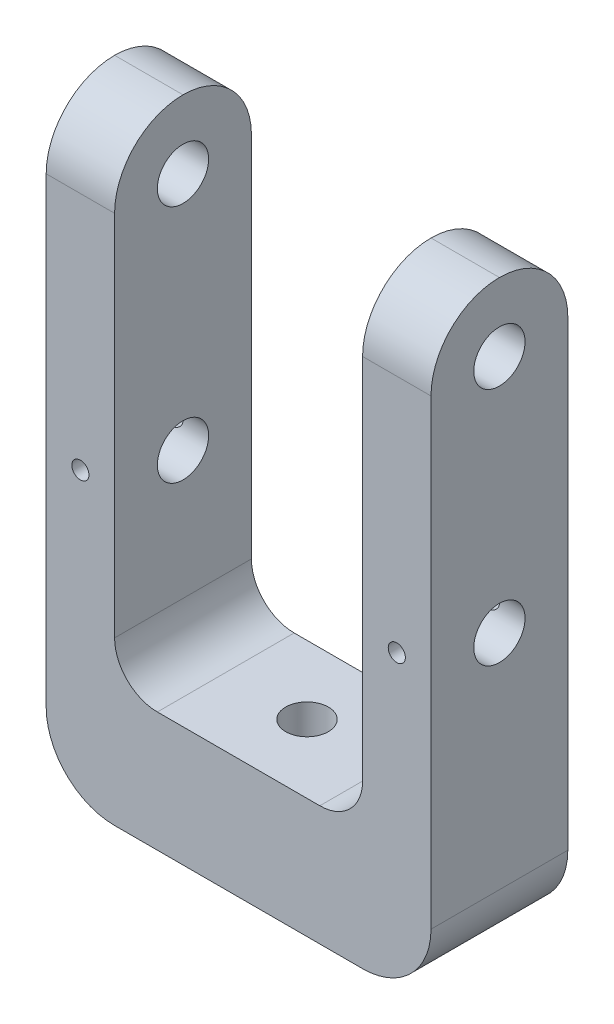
ISO-10303-21;
HEADER;
FILE_DESCRIPTION(('STEP AP214'),'2;1');
FILE_NAME('part.step','',(''),(''),'','','');
FILE_SCHEMA(('AUTOMOTIVE_DESIGN { 1 0 10303 214 1 1 1 1 }'));
ENDSEC;
DATA;
#1=APPLICATION_CONTEXT('core data for automotive mechanical design processes');
#2=APPLICATION_PROTOCOL_DEFINITION('international standard','automotive_design',2000,#1);
#3=PRODUCT_CONTEXT('',#1,'mechanical');
#4=PRODUCT('Part','Part','',(#3));
#5=PRODUCT_RELATED_PRODUCT_CATEGORY('part','',(#4));
#6=PRODUCT_DEFINITION_FORMATION('','',#4);
#7=PRODUCT_DEFINITION_CONTEXT('part definition',#1,'design');
#8=PRODUCT_DEFINITION('design','',#6,#7);
#9=PRODUCT_DEFINITION_SHAPE('','',#8);
#10=(LENGTH_UNIT() NAMED_UNIT(*) SI_UNIT(.MILLI.,.METRE.));
#11=(NAMED_UNIT(*) PLANE_ANGLE_UNIT() SI_UNIT($,.RADIAN.));
#12=(NAMED_UNIT(*) SI_UNIT($,.STERADIAN.) SOLID_ANGLE_UNIT());
#13=UNCERTAINTY_MEASURE_WITH_UNIT(LENGTH_MEASURE(1.E-05),#10,'distance_accuracy_value','');
#14=(GEOMETRIC_REPRESENTATION_CONTEXT(3) GLOBAL_UNCERTAINTY_ASSIGNED_CONTEXT((#13)) GLOBAL_UNIT_ASSIGNED_CONTEXT((#10,
#11,#12)) REPRESENTATION_CONTEXT('',''));
#15=CARTESIAN_POINT('',(0.,0.,0.));
#16=DIRECTION('',(0.,0.,1.));
#17=DIRECTION('',(1.,0.,0.));
#18=AXIS2_PLACEMENT_3D('',#15,#16,#17);
#19=CARTESIAN_POINT('',(18.5,34.0000000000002,7.99999999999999));
#20=DIRECTION('',(0.,0.,-1.00000000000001));
#21=DIRECTION('',(-1.,0.,0.));
#22=AXIS2_PLACEMENT_3D('',#19,#20,#21);
#23=CYLINDRICAL_SURFACE('',#22,1.);
#24=CARTESIAN_POINT('',(17.5,34.0000000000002,2.99999999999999));
#25=CARTESIAN_POINT('',(17.4999997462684,33.9454366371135,3.00000015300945));
#26=CARTESIAN_POINT('',(17.5044802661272,33.8908748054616,2.99849769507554));
#27=CARTESIAN_POINT('',(17.5222291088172,33.7833582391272,2.99265210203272));
#28=CARTESIAN_POINT('',(17.5354983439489,33.7304036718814,2.98830867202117));
#29=CARTESIAN_POINT('',(17.5703192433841,33.6276672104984,2.97725307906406));
#30=CARTESIAN_POINT('',(17.5918570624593,33.5778801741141,2.97054487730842));
#31=CARTESIAN_POINT('',(17.6425411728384,33.4826250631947,2.9554444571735));
#32=CARTESIAN_POINT('',(17.6716889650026,33.4371578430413,2.94705190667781));
#33=CARTESIAN_POINT('',(17.7378258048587,33.3502583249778,2.92914094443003));
#34=CARTESIAN_POINT('',(17.7750312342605,33.3089962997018,2.91959556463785));
#35=CARTESIAN_POINT('',(17.8557671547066,33.2331673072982,2.90060314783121));
#36=CARTESIAN_POINT('',(17.8992990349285,33.1986018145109,2.89115613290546));
#37=CARTESIAN_POINT('',(17.9929851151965,33.1361750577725,2.87313332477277));
#38=CARTESIAN_POINT('',(18.0432937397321,33.1085351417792,2.864590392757));
#39=CARTESIAN_POINT('',(18.1481760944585,33.0621811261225,2.84975305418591));
#40=CARTESIAN_POINT('',(18.2027485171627,33.0434643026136,2.84345796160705));
#41=CARTESIAN_POINT('',(18.3126732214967,33.0161265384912,2.83411303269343));
#42=CARTESIAN_POINT('',(18.3679372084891,33.0071865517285,2.83096095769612));
#43=CARTESIAN_POINT('',(18.4792637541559,32.9986588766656,2.82795656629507));
#44=CARTESIAN_POINT('',(18.5353260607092,32.9990682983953,2.82810323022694));
#45=CARTESIAN_POINT('',(18.643936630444,33.0089800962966,2.83159015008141));
#46=CARTESIAN_POINT('',(18.696528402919,33.0180660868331,2.83478415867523));
#47=CARTESIAN_POINT('',(18.7993934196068,33.0443938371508,2.84376657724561));
#48=CARTESIAN_POINT('',(18.8496663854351,33.0616365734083,2.84955529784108));
#49=CARTESIAN_POINT('',(18.9474127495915,33.10406094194,2.86317911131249));
#50=CARTESIAN_POINT('',(18.9948280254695,33.1293659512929,2.87104565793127));
#51=CARTESIAN_POINT('',(19.0848709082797,33.1871108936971,2.88792558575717));
#52=CARTESIAN_POINT('',(19.1274971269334,33.2195528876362,2.89693929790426));
#53=CARTESIAN_POINT('',(19.2090915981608,33.2926506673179,2.91567329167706));
#54=CARTESIAN_POINT('',(19.247752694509,33.3336468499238,2.92540589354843));
#55=CARTESIAN_POINT('',(19.3177312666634,33.4216604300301,2.94406938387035));
#56=CARTESIAN_POINT('',(19.3490480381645,33.4686784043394,2.9530001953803));
#57=CARTESIAN_POINT('',(19.4036963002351,33.5680523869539,2.96917107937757));
#58=CARTESIAN_POINT('',(19.4269454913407,33.6204567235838,2.97639350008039));
#59=CARTESIAN_POINT('',(19.4642031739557,33.7287309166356,2.98820567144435));
#60=CARTESIAN_POINT('',(19.4782148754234,33.7845995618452,2.99279633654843));
#61=CARTESIAN_POINT('',(19.4960556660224,33.8956161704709,2.99867627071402));
#62=CARTESIAN_POINT('',(19.5002998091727,33.9506904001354,3.0001000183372));
#63=CARTESIAN_POINT('',(19.4996673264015,34.0607750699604,2.99988902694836));
#64=CARTESIAN_POINT('',(19.4947922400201,34.1157855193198,2.99825480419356));
#65=CARTESIAN_POINT('',(19.476388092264,34.2225198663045,2.99220024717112));
#66=CARTESIAN_POINT('',(19.4631137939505,34.274292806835,2.98786198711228));
#67=CARTESIAN_POINT('',(19.4286065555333,34.3748559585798,2.97691846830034));
#68=CARTESIAN_POINT('',(19.4073726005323,34.4236457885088,2.9703129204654));
#69=CARTESIAN_POINT('',(19.3569295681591,34.5182882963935,2.95528931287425));
#70=CARTESIAN_POINT('',(19.3275254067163,34.5640299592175,2.94682814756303));
#71=CARTESIAN_POINT('',(19.2618058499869,34.6500648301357,2.92905253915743));
#72=CARTESIAN_POINT('',(19.2254883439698,34.6903563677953,2.91973783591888));
#73=CARTESIAN_POINT('',(19.1450212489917,34.7662525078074,2.90076847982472));
#74=CARTESIAN_POINT('',(19.1005907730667,34.8015609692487,2.89111761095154));
#75=CARTESIAN_POINT('',(19.0062284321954,34.8642575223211,2.87299973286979));
#76=CARTESIAN_POINT('',(18.9562965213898,34.8916455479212,2.86453273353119));
#77=CARTESIAN_POINT('',(18.8523269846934,34.9375969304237,2.84982391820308));
#78=CARTESIAN_POINT('',(18.7982979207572,34.956178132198,2.84357760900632));
#79=CARTESIAN_POINT('',(18.6876213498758,34.9838946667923,2.83410832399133));
#80=CARTESIAN_POINT('',(18.6309750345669,34.9930342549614,2.83088398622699));
#81=CARTESIAN_POINT('',(18.5198029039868,35.0012762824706,2.82797858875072));
#82=CARTESIAN_POINT('',(18.4653176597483,35.0008702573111,2.82812400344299));
#83=CARTESIAN_POINT('',(18.3572349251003,34.9912422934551,2.8315126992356));
#84=CARTESIAN_POINT('',(18.3036373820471,34.9820208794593,2.83475579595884));
#85=CARTESIAN_POINT('',(18.1998643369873,34.9553718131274,2.84384524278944));
#86=CARTESIAN_POINT('',(18.1496431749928,34.9381033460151,2.84964098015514));
#87=CARTESIAN_POINT('',(18.0527725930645,34.8959793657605,2.86316398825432));
#88=CARTESIAN_POINT('',(18.0061239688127,34.8711221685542,2.87089168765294));
#89=CARTESIAN_POINT('',(17.9155163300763,34.8132606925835,2.88782829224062));
#90=CARTESIAN_POINT('',(17.8717634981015,34.7799482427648,2.89708711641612));
#91=CARTESIAN_POINT('',(17.7903101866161,34.706642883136,2.91583356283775));
#92=CARTESIAN_POINT('',(17.752611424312,34.6666480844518,2.92532124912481));
#93=CARTESIAN_POINT('',(17.6828555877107,34.579241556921,2.94390030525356));
#94=CARTESIAN_POINT('',(17.651075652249,34.5316015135,2.95296181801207));
#95=CARTESIAN_POINT('',(17.5960095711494,34.4313573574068,2.96925991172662));
#96=CARTESIAN_POINT('',(17.572721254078,34.3787545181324,2.97649695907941));
#97=CARTESIAN_POINT('',(17.5362783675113,34.272493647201,2.98805515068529));
#98=CARTESIAN_POINT('',(17.5227175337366,34.2189877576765,2.99249212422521));
#99=CARTESIAN_POINT('',(17.5045797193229,34.1103204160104,2.99846407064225));
#100=CARTESIAN_POINT('',(17.5000002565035,34.0551594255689,2.99999984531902));
#101=CARTESIAN_POINT('',(17.5,34.0000000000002,2.99999999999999));
#102=B_SPLINE_CURVE_WITH_KNOTS('',3,(#24,#25,#26,#27,#28,#29,#30,#31,#32,#33,#34,#35,#36,#37,
#38,#39,#40,#41,#42,#43,#44,#45,#46,#47,#48,#49,#50,#51,#52,#53,#54,#55,#56,#57,#58,#59,#60,#61,
#62,#63,#64,#65,#66,#67,#68,#69,#70,#71,#72,#73,#74,#75,#76,#77,#78,#79,#80,#81,#82,#83,#84,#85,
#86,#87,#88,#89,#90,#91,#92,#93,#94,#95,#96,#97,#98,#99,#100,#101),.UNSPECIFIED.,.T.,.F.,(4,2,2,
2,2,2,2,2,2,2,2,2,2,2,2,2,2,2,2,2,2,2,2,2,2,2,2,2,2,2,2,2,2,2,2,2,2,2,4),(0.,0.16348710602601,
0.326991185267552,0.490222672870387,0.653486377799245,0.821846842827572,0.990244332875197,
1.16348384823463,1.33667044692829,1.50401925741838,1.67131633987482,1.83096826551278,
1.99063930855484,2.15288171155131,2.31517102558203,2.48593305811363,2.65671145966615,
2.82918405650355,3.00159668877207,3.16653583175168,3.33144713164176,3.49158157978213,
3.65173645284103,3.81610399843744,3.98052180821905,4.15241022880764,4.32430008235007,
4.49584013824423,4.6673028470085,4.82995666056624,4.99260079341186,5.1521558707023,
5.31174638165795,5.47830066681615,5.64490211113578,5.81799660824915,5.99104681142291,
6.15636558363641,6.32163866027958),.UNSPECIFIED.);
#103=CARTESIAN_POINT('',(17.5,34.0000000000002,2.99999999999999));
#104=VERTEX_POINT('',#103);
#105=EDGE_CURVE('E265',#104,#104,#102,.T.);
#106=ORIENTED_EDGE('',*,*,#105,.F.);
#107=EDGE_LOOP('',(#106));
#108=FACE_BOUND('',#107,.T.);
#109=CARTESIAN_POINT('',(18.5,34.0000000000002,7.99999999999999));
#110=DIRECTION('',(0.,0.,1.00000000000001));
#111=DIRECTION('',(1.,0.,0.));
#112=AXIS2_PLACEMENT_3D('',#109,#110,#111);
#113=CIRCLE('',#112,1.);
#114=CARTESIAN_POINT('',(19.5,34.0000000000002,7.99999999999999));
#115=VERTEX_POINT('',#114);
#116=EDGE_CURVE('E349',#115,#115,#113,.T.);
#117=ORIENTED_EDGE('',*,*,#116,.T.);
#118=EDGE_LOOP('',(#117));
#119=FACE_BOUND('',#118,.T.);
#120=ADVANCED_FACE('F34',(#108,#119),#23,.F.);
#121=CARTESIAN_POINT('',(-18.5,34.0000000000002,7.99999999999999));
#122=DIRECTION('',(0.,0.,-1.00000000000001));
#123=DIRECTION('',(-1.,0.,0.));
#124=AXIS2_PLACEMENT_3D('',#121,#122,#123);
#125=CYLINDRICAL_SURFACE('',#124,1.);
#126=CARTESIAN_POINT('',(-19.5,34.0000000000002,3.));
#127=CARTESIAN_POINT('',(-19.5000002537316,33.9454366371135,3.00000015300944));
#128=CARTESIAN_POINT('',(-19.4955197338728,33.8908748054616,2.99849769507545));
#129=CARTESIAN_POINT('',(-19.4777708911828,33.7833582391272,2.99265210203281));
#130=CARTESIAN_POINT('',(-19.4645016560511,33.7304036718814,2.98830867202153));
#131=CARTESIAN_POINT('',(-19.4296807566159,33.6276672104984,2.97725307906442));
#132=CARTESIAN_POINT('',(-19.4081429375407,33.5778801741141,2.97054487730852));
#133=CARTESIAN_POINT('',(-19.3574588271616,33.4826250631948,2.95544445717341));
#134=CARTESIAN_POINT('',(-19.3283110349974,33.4371578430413,2.94705190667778));
#135=CARTESIAN_POINT('',(-19.2621741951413,33.3502583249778,2.92914094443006));
#136=CARTESIAN_POINT('',(-19.2249687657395,33.3089962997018,2.91959556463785));
#137=CARTESIAN_POINT('',(-19.1442328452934,33.2331673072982,2.90060314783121));
#138=CARTESIAN_POINT('',(-19.1007009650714,33.1986018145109,2.89115613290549));
#139=CARTESIAN_POINT('',(-19.0070148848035,33.1361750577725,2.87313332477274));
#140=CARTESIAN_POINT('',(-18.9567062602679,33.1085351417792,2.8645903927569));
#141=CARTESIAN_POINT('',(-18.8518239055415,33.0621811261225,2.84975305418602));
#142=CARTESIAN_POINT('',(-18.7972514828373,33.0434643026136,2.84345796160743));
#143=CARTESIAN_POINT('',(-18.6873267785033,33.0161265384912,2.8341130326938));
#144=CARTESIAN_POINT('',(-18.6320627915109,33.0071865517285,2.8309609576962));
#145=CARTESIAN_POINT('',(-18.5207362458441,32.9986588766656,2.82795656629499));
#146=CARTESIAN_POINT('',(-18.4646739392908,32.9990682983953,2.82810323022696));
#147=CARTESIAN_POINT('',(-18.356063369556,33.0089800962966,2.83159015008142));
#148=CARTESIAN_POINT('',(-18.303471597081,33.0180660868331,2.83478415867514));
#149=CARTESIAN_POINT('',(-18.2006065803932,33.0443938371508,2.8437665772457));
#150=CARTESIAN_POINT('',(-18.1503336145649,33.0616365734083,2.84955529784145));
#151=CARTESIAN_POINT('',(-18.0525872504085,33.10406094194,2.86317911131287));
#152=CARTESIAN_POINT('',(-18.0051719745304,33.1293659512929,2.87104565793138));
#153=CARTESIAN_POINT('',(-17.9151290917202,33.1871108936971,2.88792558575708));
#154=CARTESIAN_POINT('',(-17.8725028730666,33.2195528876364,2.89693929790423));
#155=CARTESIAN_POINT('',(-17.7909084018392,33.2926506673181,2.91567329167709));
#156=CARTESIAN_POINT('',(-17.7522473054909,33.3336468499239,2.92540589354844));
#157=CARTESIAN_POINT('',(-17.6822687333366,33.4216604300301,2.94406938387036));
#158=CARTESIAN_POINT('',(-17.6509519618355,33.4686784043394,2.9530001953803));
#159=CARTESIAN_POINT('',(-17.5963036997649,33.5680523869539,2.96917107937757));
#160=CARTESIAN_POINT('',(-17.5730545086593,33.6204567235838,2.97639350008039));
#161=CARTESIAN_POINT('',(-17.5357968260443,33.7287309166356,2.98820567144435));
#162=CARTESIAN_POINT('',(-17.5217851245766,33.7845995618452,2.99279633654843));
#163=CARTESIAN_POINT('',(-17.5039443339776,33.8956161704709,2.99867627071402));
#164=CARTESIAN_POINT('',(-17.4997001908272,33.9506904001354,3.0001000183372));
#165=CARTESIAN_POINT('',(-17.5003326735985,34.0607750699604,2.99988902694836));
#166=CARTESIAN_POINT('',(-17.5052077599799,34.1157855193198,2.99825480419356));
#167=CARTESIAN_POINT('',(-17.523611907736,34.2225198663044,2.99220024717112));
#168=CARTESIAN_POINT('',(-17.5368862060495,34.274292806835,2.98786198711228));
#169=CARTESIAN_POINT('',(-17.5713934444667,34.3748559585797,2.97691846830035));
#170=CARTESIAN_POINT('',(-17.5926273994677,34.4236457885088,2.97031292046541));
#171=CARTESIAN_POINT('',(-17.6430704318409,34.5182882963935,2.95528931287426));
#172=CARTESIAN_POINT('',(-17.6724745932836,34.5640299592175,2.94682814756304));
#173=CARTESIAN_POINT('',(-17.7381941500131,34.6500648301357,2.92905253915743));
#174=CARTESIAN_POINT('',(-17.7745116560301,34.6903563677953,2.91973783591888));
#175=CARTESIAN_POINT('',(-17.8549787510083,34.7662525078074,2.90076847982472));
#176=CARTESIAN_POINT('',(-17.8994092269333,34.8015609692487,2.89111761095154));
#177=CARTESIAN_POINT('',(-17.9937715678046,34.8642575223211,2.87299973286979));
#178=CARTESIAN_POINT('',(-18.0437034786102,34.8916455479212,2.86453273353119));
#179=CARTESIAN_POINT('',(-18.1476730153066,34.9375969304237,2.84982391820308));
#180=CARTESIAN_POINT('',(-18.2017020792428,34.956178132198,2.84357760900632));
#181=CARTESIAN_POINT('',(-18.3123786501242,34.9838946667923,2.83410832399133));
#182=CARTESIAN_POINT('',(-18.3690249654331,34.9930342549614,2.83088398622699));
#183=CARTESIAN_POINT('',(-18.4801970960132,35.0012762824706,2.82797858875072));
#184=CARTESIAN_POINT('',(-18.5346823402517,35.0008702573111,2.82812400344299));
#185=CARTESIAN_POINT('',(-18.6427650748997,34.9912422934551,2.8315126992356));
#186=CARTESIAN_POINT('',(-18.6963626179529,34.9820208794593,2.83475579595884));
#187=CARTESIAN_POINT('',(-18.8001356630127,34.9553718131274,2.84384524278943));
#188=CARTESIAN_POINT('',(-18.8503568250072,34.9381033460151,2.84964098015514));
#189=CARTESIAN_POINT('',(-18.9472274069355,34.8959793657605,2.86316398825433));
#190=CARTESIAN_POINT('',(-18.9938760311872,34.8711221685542,2.87089168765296));
#191=CARTESIAN_POINT('',(-19.0844836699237,34.8132606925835,2.8878282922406));
#192=CARTESIAN_POINT('',(-19.1282365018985,34.7799482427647,2.89708711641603));
#193=CARTESIAN_POINT('',(-19.209689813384,34.706642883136,2.91583356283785));
#194=CARTESIAN_POINT('',(-19.247388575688,34.6666480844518,2.92532124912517));
#195=CARTESIAN_POINT('',(-19.3171444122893,34.579241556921,2.94390030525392));
#196=CARTESIAN_POINT('',(-19.348924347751,34.5316015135,2.95296181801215));
#197=CARTESIAN_POINT('',(-19.4039904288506,34.4313573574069,2.96925991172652));
#198=CARTESIAN_POINT('',(-19.427278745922,34.3787545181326,2.97649695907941));
#199=CARTESIAN_POINT('',(-19.4637216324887,34.2724936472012,2.98805515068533));
#200=CARTESIAN_POINT('',(-19.4772824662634,34.2189877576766,2.9924921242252));
#201=CARTESIAN_POINT('',(-19.4954202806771,34.1103204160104,2.99846407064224));
#202=CARTESIAN_POINT('',(-19.4999997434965,34.0551594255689,2.99999984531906));
#203=CARTESIAN_POINT('',(-19.5,34.0000000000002,3.));
#204=B_SPLINE_CURVE_WITH_KNOTS('',3,(#126,#127,#128,#129,#130,#131,#132,#133,#134,#135,#136,
#137,#138,#139,#140,#141,#142,#143,#144,#145,#146,#147,#148,#149,#150,#151,#152,#153,#154,#155,
#156,#157,#158,#159,#160,#161,#162,#163,#164,#165,#166,#167,#168,#169,#170,#171,#172,#173,#174,
#175,#176,#177,#178,#179,#180,#181,#182,#183,#184,#185,#186,#187,#188,#189,#190,#191,#192,#193,
#194,#195,#196,#197,#198,#199,#200,#201,#202,#203),.UNSPECIFIED.,.T.,.F.,(4,2,2,2,2,2,2,2,2,2,2,
2,2,2,2,2,2,2,2,2,2,2,2,2,2,2,2,2,2,2,2,2,2,2,2,2,2,2,4),(0.,0.163487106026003,
0.326991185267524,0.490222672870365,0.65348637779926,0.82184684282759,0.990244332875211,
1.16348384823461,1.33667044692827,1.50401925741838,1.67131633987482,1.83096826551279,
1.99063930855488,2.15288171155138,2.31517102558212,2.48593305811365,2.65671145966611,
2.8291840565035,3.00159668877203,3.16653583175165,3.33144713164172,3.49158157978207,
3.65173645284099,3.81610399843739,3.98052180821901,4.1524102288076,4.32430008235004,
4.49584013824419,4.66730284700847,4.82995666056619,4.99260079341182,5.15215587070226,
5.31174638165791,5.47830066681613,5.64490211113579,5.81799660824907,5.99104681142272,
6.15636558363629,6.32163866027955),.UNSPECIFIED.);
#205=CARTESIAN_POINT('',(-19.5,34.0000000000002,3.));
#206=VERTEX_POINT('',#205);
#207=EDGE_CURVE('E38',#206,#206,#204,.T.);
#208=ORIENTED_EDGE('',*,*,#207,.F.);
#209=EDGE_LOOP('',(#208));
#210=FACE_BOUND('',#209,.T.);
#211=CARTESIAN_POINT('',(-18.5,34.0000000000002,7.99999999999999));
#212=DIRECTION('',(0.,0.,1.00000000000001));
#213=DIRECTION('',(-1.,0.,0.));
#214=AXIS2_PLACEMENT_3D('',#211,#212,#213);
#215=CIRCLE('',#214,1.);
#216=CARTESIAN_POINT('',(-19.5,34.0000000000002,7.99999999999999));
#217=VERTEX_POINT('',#216);
#218=EDGE_CURVE('E356',#217,#217,#215,.T.);
#219=ORIENTED_EDGE('',*,*,#218,.T.);
#220=EDGE_LOOP('',(#219));
#221=FACE_BOUND('',#220,.T.);
#222=ADVANCED_FACE('F281',(#210,#221),#125,.F.);
#223=CARTESIAN_POINT('',(22.5,0.,7.99999999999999));
#224=DIRECTION('',(0.,0.,1.00000000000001));
#225=DIRECTION('',(1.,0.,0.));
#226=AXIS2_PLACEMENT_3D('',#223,#224,#225);
#227=PLANE('',#226);
#228=ORIENTED_EDGE('',*,*,#116,.F.);
#229=EDGE_LOOP('',(#228));
#230=FACE_BOUND('',#229,.T.);
#231=DIRECTION('',(0.,1.00000000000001,0.));
#232=VECTOR('',#231,1.);
#233=CARTESIAN_POINT('',(22.5,70.0000000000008,7.99999999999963));
#234=LINE('',#233,#232);
#235=CARTESIAN_POINT('',(22.5,8.,7.99999999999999));
#236=VERTEX_POINT('',#235);
#237=CARTESIAN_POINT('',(22.5,62.0000000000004,8.00000000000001));
#238=VERTEX_POINT('',#237);
#239=EDGE_CURVE('E178',#236,#238,#234,.T.);
#240=ORIENTED_EDGE('',*,*,#239,.T.);
#241=DIRECTION('',(-1.,0.,0.));
#242=VECTOR('',#241,1.);
#243=CARTESIAN_POINT('',(14.5,62.0000000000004,8.00000000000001));
#244=LINE('',#243,#242);
#245=CARTESIAN_POINT('',(14.5,62.0000000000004,8.00000000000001));
#246=VERTEX_POINT('',#245);
#247=EDGE_CURVE('E225',#238,#246,#244,.T.);
#248=ORIENTED_EDGE('',*,*,#247,.T.);
#249=DIRECTION('',(0.,-1.00000000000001,0.));
#250=VECTOR('',#249,1.);
#251=CARTESIAN_POINT('',(14.5,14.0000000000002,7.99999999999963));
#252=LINE('',#251,#250);
#253=CARTESIAN_POINT('',(14.5,19.0000000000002,7.99999999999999));
#254=VERTEX_POINT('',#253);
#255=EDGE_CURVE('E363',#246,#254,#252,.T.);
#256=ORIENTED_EDGE('',*,*,#255,.T.);
#257=CARTESIAN_POINT('',(9.50000000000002,19.0000000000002,7.99999999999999));
#258=DIRECTION('',(0.,0.,1.00000000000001));
#259=DIRECTION('',(1.,0.,0.));
#260=AXIS2_PLACEMENT_3D('',#257,#258,#259);
#261=CIRCLE('',#260,5.);
#262=CARTESIAN_POINT('',(9.50000000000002,14.0000000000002,7.99999999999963));
#263=VERTEX_POINT('',#262);
#264=EDGE_CURVE('E189',#254,#263,#261,.F.);
#265=ORIENTED_EDGE('',*,*,#264,.T.);
#266=DIRECTION('',(-1.,0.,0.));
#267=VECTOR('',#266,1.);
#268=CARTESIAN_POINT('',(-14.5,14.0000000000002,7.99999999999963));
#269=LINE('',#268,#267);
#270=CARTESIAN_POINT('',(-9.49999999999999,14.0000000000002,7.99999999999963));
#271=VERTEX_POINT('',#270);
#272=EDGE_CURVE('E365',#263,#271,#269,.T.);
#273=ORIENTED_EDGE('',*,*,#272,.T.);
#274=CARTESIAN_POINT('',(-9.49999999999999,19.0000000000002,8.00000000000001));
#275=DIRECTION('',(0.,0.,1.00000000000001));
#276=DIRECTION('',(1.,0.,0.));
#277=AXIS2_PLACEMENT_3D('',#274,#275,#276);
#278=CIRCLE('',#277,5.);
#279=CARTESIAN_POINT('',(-14.5,19.0000000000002,8.00000000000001));
#280=VERTEX_POINT('',#279);
#281=EDGE_CURVE('E150',#271,#280,#278,.F.);
#282=ORIENTED_EDGE('',*,*,#281,.T.);
#283=DIRECTION('',(0.,1.00000000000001,0.));
#284=VECTOR('',#283,1.);
#285=CARTESIAN_POINT('',(-14.5,14.0000000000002,7.99999999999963));
#286=LINE('',#285,#284);
#287=CARTESIAN_POINT('',(-14.5,62.0000000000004,8.00000000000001));
#288=VERTEX_POINT('',#287);
#289=EDGE_CURVE('E157',#280,#288,#286,.T.);
#290=ORIENTED_EDGE('',*,*,#289,.T.);
#291=DIRECTION('',(-1.,0.,0.));
#292=VECTOR('',#291,1.);
#293=CARTESIAN_POINT('',(-22.5,62.0000000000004,8.00000000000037));
#294=LINE('',#293,#292);
#295=CARTESIAN_POINT('',(-22.5,62.0000000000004,8.00000000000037));
#296=VERTEX_POINT('',#295);
#297=EDGE_CURVE('E223',#288,#296,#294,.T.);
#298=ORIENTED_EDGE('',*,*,#297,.T.);
#299=DIRECTION('',(0.,-1.00000000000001,0.));
#300=VECTOR('',#299,1.);
#301=CARTESIAN_POINT('',(-22.5,70.0000000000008,7.99999999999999));
#302=LINE('',#301,#300);
#303=CARTESIAN_POINT('',(-22.5,8.,8.00000000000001));
#304=VERTEX_POINT('',#303);
#305=EDGE_CURVE('E369',#296,#304,#302,.T.);
#306=ORIENTED_EDGE('',*,*,#305,.T.);
#307=CARTESIAN_POINT('',(-14.5,8.,8.00000000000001));
#308=DIRECTION('',(0.,0.,1.00000000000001));
#309=DIRECTION('',(1.,0.,0.));
#310=AXIS2_PLACEMENT_3D('',#307,#308,#309);
#311=CIRCLE('',#310,8.);
#312=CARTESIAN_POINT('',(-14.5,0.,7.99999999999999));
#313=VERTEX_POINT('',#312);
#314=EDGE_CURVE('E206',#304,#313,#311,.T.);
#315=ORIENTED_EDGE('',*,*,#314,.T.);
#316=DIRECTION('',(1.,0.,0.));
#317=VECTOR('',#316,1.);
#318=CARTESIAN_POINT('',(-22.5,0.,8.00000000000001));
#319=LINE('',#318,#317);
#320=CARTESIAN_POINT('',(14.5,0.,7.99999999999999));
#321=VERTEX_POINT('',#320);
#322=EDGE_CURVE('E159',#313,#321,#319,.T.);
#323=ORIENTED_EDGE('',*,*,#322,.T.);
#324=CARTESIAN_POINT('',(14.5,8.,7.99999999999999));
#325=DIRECTION('',(0.,0.,1.00000000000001));
#326=DIRECTION('',(1.,0.,0.));
#327=AXIS2_PLACEMENT_3D('',#324,#325,#326);
#328=CIRCLE('',#327,8.);
#329=EDGE_CURVE('E204',#321,#236,#328,.T.);
#330=ORIENTED_EDGE('',*,*,#329,.T.);
#331=EDGE_LOOP('',(#240,#248,#256,#265,#273,#282,#290,#298,#306,#315,#323,#330));
#332=FACE_BOUND('',#331,.T.);
#333=ORIENTED_EDGE('',*,*,#218,.F.);
#334=EDGE_LOOP('',(#333));
#335=FACE_BOUND('',#334,.T.);
#336=ADVANCED_FACE('F277',(#230,#332,#335),#227,.T.);
#337=CARTESIAN_POINT('',(22.5000000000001,-1.87350135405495E-13,-8.00000000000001));
#338=DIRECTION('',(0.,0.,1.00000000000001));
#339=DIRECTION('',(1.,0.,0.));
#340=AXIS2_PLACEMENT_3D('',#337,#338,#339);
#341=PLANE('',#340);
#342=CARTESIAN_POINT('',(18.5,34.0000000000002,-8.00000000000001));
#343=DIRECTION('',(0.,0.,1.00000000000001));
#344=DIRECTION('',(1.,0.,0.));
#345=AXIS2_PLACEMENT_3D('',#342,#343,#344);
#346=CIRCLE('',#345,1.);
#347=CARTESIAN_POINT('',(19.5,34.0000000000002,-8.00000000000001));
#348=VERTEX_POINT('',#347);
#349=EDGE_CURVE('E351',#348,#348,#346,.T.);
#350=ORIENTED_EDGE('',*,*,#349,.T.);
#351=EDGE_LOOP('',(#350));
#352=FACE_BOUND('',#351,.T.);
#353=DIRECTION('',(0.,-1.00000000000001,0.));
#354=VECTOR('',#353,1.);
#355=CARTESIAN_POINT('',(14.5,14.,-7.99999999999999));
#356=LINE('',#355,#354);
#357=CARTESIAN_POINT('',(14.5,62.0000000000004,-8.00000000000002));
#358=VERTEX_POINT('',#357);
#359=CARTESIAN_POINT('',(14.5,19.0000000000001,-8.00000000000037));
#360=VERTEX_POINT('',#359);
#361=EDGE_CURVE('E173',#358,#360,#356,.T.);
#362=ORIENTED_EDGE('',*,*,#361,.F.);
#363=DIRECTION('',(-1.,0.,0.));
#364=VECTOR('',#363,1.);
#365=CARTESIAN_POINT('',(22.4999999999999,62.0000000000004,-8.00000000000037));
#366=LINE('',#365,#364);
#367=CARTESIAN_POINT('',(22.5,62.0000000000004,-8.00000000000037));
#368=VERTEX_POINT('',#367);
#369=EDGE_CURVE('E216',#358,#368,#366,.F.);
#370=ORIENTED_EDGE('',*,*,#369,.T.);
#371=DIRECTION('',(0.,1.00000000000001,0.));
#372=VECTOR('',#371,1.);
#373=CARTESIAN_POINT('',(22.5,70.0000000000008,-8.00000000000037));
#374=LINE('',#373,#372);
#375=CARTESIAN_POINT('',(22.5000000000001,8.,-8.00000000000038));
#376=VERTEX_POINT('',#375);
#377=EDGE_CURVE('E350',#376,#368,#374,.T.);
#378=ORIENTED_EDGE('',*,*,#377,.F.);
#379=CARTESIAN_POINT('',(14.5,8.,-8.00000000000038));
#380=DIRECTION('',(0.,0.,1.00000000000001));
#381=DIRECTION('',(1.,0.,0.));
#382=AXIS2_PLACEMENT_3D('',#379,#380,#381);
#383=CIRCLE('',#382,8.);
#384=CARTESIAN_POINT('',(14.4999999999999,-1.87350135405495E-13,-7.99999999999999));
#385=VERTEX_POINT('',#384);
#386=EDGE_CURVE('E196',#376,#385,#383,.F.);
#387=ORIENTED_EDGE('',*,*,#386,.T.);
#388=DIRECTION('',(1.,0.,0.));
#389=VECTOR('',#388,1.);
#390=CARTESIAN_POINT('',(-22.4999999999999,0.,-7.99999999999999));
#391=LINE('',#390,#389);
#392=CARTESIAN_POINT('',(-14.5,0.,-7.99999999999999));
#393=VERTEX_POINT('',#392);
#394=EDGE_CURVE('E171',#393,#385,#391,.T.);
#395=ORIENTED_EDGE('',*,*,#394,.F.);
#396=CARTESIAN_POINT('',(-14.5,8.,-8.00000000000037));
#397=DIRECTION('',(0.,0.,1.00000000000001));
#398=DIRECTION('',(1.,0.,0.));
#399=AXIS2_PLACEMENT_3D('',#396,#397,#398);
#400=CIRCLE('',#399,8.);
#401=CARTESIAN_POINT('',(-22.4999999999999,8.,-8.00000000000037));
#402=VERTEX_POINT('',#401);
#403=EDGE_CURVE('E198',#393,#402,#400,.F.);
#404=ORIENTED_EDGE('',*,*,#403,.T.);
#405=DIRECTION('',(0.,-1.00000000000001,0.));
#406=VECTOR('',#405,1.);
#407=CARTESIAN_POINT('',(-22.5,70.0000000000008,-8.00000000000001));
#408=LINE('',#407,#406);
#409=CARTESIAN_POINT('',(-22.5,62.0000000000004,-8.00000000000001));
#410=VERTEX_POINT('',#409);
#411=EDGE_CURVE('E168',#410,#402,#408,.T.);
#412=ORIENTED_EDGE('',*,*,#411,.F.);
#413=DIRECTION('',(-1.,0.,0.));
#414=VECTOR('',#413,1.);
#415=CARTESIAN_POINT('',(22.5000000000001,62.0000000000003,-8.00000000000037));
#416=LINE('',#415,#414);
#417=CARTESIAN_POINT('',(-14.5,62.0000000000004,-8.00000000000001));
#418=VERTEX_POINT('',#417);
#419=EDGE_CURVE('E167',#410,#418,#416,.F.);
#420=ORIENTED_EDGE('',*,*,#419,.T.);
#421=DIRECTION('',(0.,1.00000000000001,0.));
#422=VECTOR('',#421,1.);
#423=CARTESIAN_POINT('',(-14.5,14.,-7.99999999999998));
#424=LINE('',#423,#422);
#425=CARTESIAN_POINT('',(-14.5,19.0000000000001,-8.00000000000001));
#426=VERTEX_POINT('',#425);
#427=EDGE_CURVE('E155',#426,#418,#424,.T.);
#428=ORIENTED_EDGE('',*,*,#427,.F.);
#429=CARTESIAN_POINT('',(-9.49999999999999,19.0000000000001,-8.00000000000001));
#430=DIRECTION('',(0.,0.,1.00000000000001));
#431=DIRECTION('',(1.,0.,0.));
#432=AXIS2_PLACEMENT_3D('',#429,#430,#431);
#433=CIRCLE('',#432,5.);
#434=CARTESIAN_POINT('',(-9.49999999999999,14.,-7.99999999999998));
#435=VERTEX_POINT('',#434);
#436=EDGE_CURVE('E140',#426,#435,#433,.T.);
#437=ORIENTED_EDGE('',*,*,#436,.T.);
#438=DIRECTION('',(-1.,0.,0.));
#439=VECTOR('',#438,1.);
#440=CARTESIAN_POINT('',(-14.5,14.,-7.99999999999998));
#441=LINE('',#440,#439);
#442=CARTESIAN_POINT('',(9.50000000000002,14.,-7.99999999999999));
#443=VERTEX_POINT('',#442);
#444=EDGE_CURVE('E169',#443,#435,#441,.T.);
#445=ORIENTED_EDGE('',*,*,#444,.F.);
#446=CARTESIAN_POINT('',(9.50000000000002,19.0000000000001,-8.00000000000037));
#447=DIRECTION('',(0.,0.,1.00000000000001));
#448=DIRECTION('',(1.,0.,0.));
#449=AXIS2_PLACEMENT_3D('',#446,#447,#448);
#450=CIRCLE('',#449,5.);
#451=EDGE_CURVE('E186',#443,#360,#450,.T.);
#452=ORIENTED_EDGE('',*,*,#451,.T.);
#453=EDGE_LOOP('',(#362,#370,#378,#387,#395,#404,#412,#420,#428,#437,#445,#452));
#454=FACE_BOUND('',#453,.T.);
#455=CARTESIAN_POINT('',(-18.5,34.0000000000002,-7.99999999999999));
#456=DIRECTION('',(0.,0.,1.00000000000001));
#457=DIRECTION('',(-1.,0.,0.));
#458=AXIS2_PLACEMENT_3D('',#455,#456,#457);
#459=CIRCLE('',#458,1.);
#460=CARTESIAN_POINT('',(-19.5,34.0000000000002,-7.99999999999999));
#461=VERTEX_POINT('',#460);
#462=EDGE_CURVE('E234',#461,#461,#459,.T.);
#463=ORIENTED_EDGE('',*,*,#462,.T.);
#464=EDGE_LOOP('',(#463));
#465=FACE_BOUND('',#464,.T.);
#466=ADVANCED_FACE('F163',(#352,#454,#465),#341,.F.);
#467=CARTESIAN_POINT('',(22.5,70.0000000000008,7.99999999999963));
#468=DIRECTION('',(-1.,0.,0.));
#469=DIRECTION('',(0.,0.,1.00000000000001));
#470=AXIS2_PLACEMENT_3D('',#467,#468,#469);
#471=PLANE('',#470);
#472=CARTESIAN_POINT('',(22.5,62.0000000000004,-3.7470027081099E-13));
#473=DIRECTION('',(1.,0.,0.));
#474=DIRECTION('',(0.,0.,-1.00000000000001));
#475=AXIS2_PLACEMENT_3D('',#472,#473,#474);
#476=CIRCLE('',#475,3.);
#477=CARTESIAN_POINT('',(22.5,62.0000000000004,-3.00000000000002));
#478=VERTEX_POINT('',#477);
#479=EDGE_CURVE('E503',#478,#478,#476,.T.);
#480=ORIENTED_EDGE('',*,*,#479,.F.);
#481=EDGE_LOOP('',(#480));
#482=FACE_BOUND('',#481,.T.);
#483=CARTESIAN_POINT('',(22.5,34.0000000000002,0.));
#484=DIRECTION('',(1.,0.,0.));
#485=DIRECTION('',(0.,0.,-1.00000000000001));
#486=AXIS2_PLACEMENT_3D('',#483,#484,#485);
#487=CIRCLE('',#486,3.);
#488=CARTESIAN_POINT('',(22.5,34.0000000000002,-3.00000000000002));
#489=VERTEX_POINT('',#488);
#490=EDGE_CURVE('E266',#489,#489,#487,.T.);
#491=ORIENTED_EDGE('',*,*,#490,.F.);
#492=EDGE_LOOP('',(#491));
#493=FACE_BOUND('',#492,.T.);
#494=ORIENTED_EDGE('',*,*,#377,.T.);
#495=CARTESIAN_POINT('',(22.5,62.0000000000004,-3.7470027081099E-13));
#496=DIRECTION('',(-1.,0.,0.));
#497=DIRECTION('',(0.,0.,1.00000000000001));
#498=AXIS2_PLACEMENT_3D('',#495,#496,#497);
#499=CIRCLE('',#498,8.);
#500=CARTESIAN_POINT('',(22.5,70.0000000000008,-3.7470027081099E-13));
#501=VERTEX_POINT('',#500);
#502=EDGE_CURVE('E221',#368,#501,#499,.F.);
#503=ORIENTED_EDGE('',*,*,#502,.T.);
#504=CARTESIAN_POINT('',(22.5,62.0000000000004,-3.7470027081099E-13));
#505=DIRECTION('',(-1.,0.,0.));
#506=DIRECTION('',(0.,0.,1.00000000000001));
#507=AXIS2_PLACEMENT_3D('',#504,#505,#506);
#508=CIRCLE('',#507,8.);
#509=EDGE_CURVE('E219',#501,#238,#508,.F.);
#510=ORIENTED_EDGE('',*,*,#509,.T.);
#511=ORIENTED_EDGE('',*,*,#239,.F.);
#512=DIRECTION('',(0.,0.,-1.00000000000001));
#513=VECTOR('',#512,1.);
#514=CARTESIAN_POINT('',(22.5,8.,7.99999999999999));
#515=LINE('',#514,#513);
#516=EDGE_CURVE('E208',#236,#376,#515,.T.);
#517=ORIENTED_EDGE('',*,*,#516,.T.);
#518=EDGE_LOOP('',(#494,#503,#510,#511,#517));
#519=FACE_BOUND('',#518,.T.);
#520=ADVANCED_FACE('F285',(#482,#493,#519),#471,.F.);
#521=CARTESIAN_POINT('',(14.5,14.0000000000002,7.99999999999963));
#522=DIRECTION('',(1.,0.,0.));
#523=DIRECTION('',(0.,1.00000000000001,0.));
#524=AXIS2_PLACEMENT_3D('',#521,#522,#523);
#525=PLANE('',#524);
#526=CARTESIAN_POINT('',(14.5,62.0000000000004,-3.7470027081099E-13));
#527=DIRECTION('',(1.,0.,0.));
#528=DIRECTION('',(0.,1.00000000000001,0.));
#529=AXIS2_PLACEMENT_3D('',#526,#527,#528);
#530=CIRCLE('',#529,3.);
#531=CARTESIAN_POINT('',(14.5,62.0000000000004,-3.00000000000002));
#532=VERTEX_POINT('',#531);
#533=EDGE_CURVE('E515',#532,#532,#530,.T.);
#534=ORIENTED_EDGE('',*,*,#533,.T.);
#535=EDGE_LOOP('',(#534));
#536=FACE_BOUND('',#535,.T.);
#537=CARTESIAN_POINT('',(14.5000000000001,34.0000000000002,0.));
#538=DIRECTION('',(1.,0.,0.));
#539=DIRECTION('',(0.,1.00000000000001,0.));
#540=AXIS2_PLACEMENT_3D('',#537,#538,#539);
#541=CIRCLE('',#540,3.);
#542=CARTESIAN_POINT('',(14.5000000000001,37.0000000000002,0.));
#543=VERTEX_POINT('',#542);
#544=EDGE_CURVE('E237',#543,#543,#541,.T.);
#545=ORIENTED_EDGE('',*,*,#544,.T.);
#546=EDGE_LOOP('',(#545));
#547=FACE_BOUND('',#546,.T.);
#548=CARTESIAN_POINT('',(14.5,62.0000000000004,-3.7470027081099E-13));
#549=DIRECTION('',(1.,0.,0.));
#550=DIRECTION('',(0.,1.00000000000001,0.));
#551=AXIS2_PLACEMENT_3D('',#548,#549,#550);
#552=CIRCLE('',#551,8.);
#553=CARTESIAN_POINT('',(14.5,70.0000000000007,-3.7470027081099E-13));
#554=VERTEX_POINT('',#553);
#555=EDGE_CURVE('E211',#246,#554,#552,.F.);
#556=ORIENTED_EDGE('',*,*,#555,.T.);
#557=CARTESIAN_POINT('',(14.5,62.0000000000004,-3.7470027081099E-13));
#558=DIRECTION('',(1.,0.,0.));
#559=DIRECTION('',(0.,1.00000000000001,0.));
#560=AXIS2_PLACEMENT_3D('',#557,#558,#559);
#561=CIRCLE('',#560,8.);
#562=EDGE_CURVE('E213',#554,#358,#561,.F.);
#563=ORIENTED_EDGE('',*,*,#562,.T.);
#564=ORIENTED_EDGE('',*,*,#361,.T.);
#565=DIRECTION('',(0.,0.,-1.00000000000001));
#566=VECTOR('',#565,1.);
#567=CARTESIAN_POINT('',(14.5,19.0000000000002,7.99999999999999));
#568=LINE('',#567,#566);
#569=EDGE_CURVE('E151',#360,#254,#568,.F.);
#570=ORIENTED_EDGE('',*,*,#569,.T.);
#571=ORIENTED_EDGE('',*,*,#255,.F.);
#572=EDGE_LOOP('',(#556,#563,#564,#570,#571));
#573=FACE_BOUND('',#572,.T.);
#574=ADVANCED_FACE('F300',(#536,#547,#573),#525,.F.);
#575=CARTESIAN_POINT('',(-14.5,14.0000000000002,7.99999999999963));
#576=DIRECTION('',(0.,-1.00000000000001,0.));
#577=DIRECTION('',(0.,0.,-1.00000000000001));
#578=AXIS2_PLACEMENT_3D('',#575,#576,#577);
#579=PLANE('',#578);
#580=CARTESIAN_POINT('',(0.,14.0000000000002,-3.7470027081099E-13));
#581=DIRECTION('',(0.,-1.00000000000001,0.));
#582=DIRECTION('',(0.,0.,-1.00000000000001));
#583=AXIS2_PLACEMENT_3D('',#580,#581,#582);
#584=CIRCLE('',#583,2.49999999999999);
#585=CARTESIAN_POINT('',(0.,14.0000000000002,-2.50000000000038));
#586=VERTEX_POINT('',#585);
#587=EDGE_CURVE('E502',#586,#586,#584,.T.);
#588=ORIENTED_EDGE('',*,*,#587,.T.);
#589=EDGE_LOOP('',(#588));
#590=FACE_BOUND('',#589,.T.);
#591=ORIENTED_EDGE('',*,*,#444,.T.);
#592=DIRECTION('',(0.,0.,-1.00000000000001));
#593=VECTOR('',#592,1.);
#594=CARTESIAN_POINT('',(-9.49999999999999,14.0000000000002,7.99999999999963));
#595=LINE('',#594,#593);
#596=EDGE_CURVE('E145',#435,#271,#595,.F.);
#597=ORIENTED_EDGE('',*,*,#596,.T.);
#598=ORIENTED_EDGE('',*,*,#272,.F.);
#599=DIRECTION('',(0.,0.,-1.00000000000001));
#600=VECTOR('',#599,1.);
#601=CARTESIAN_POINT('',(9.50000000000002,14.,-7.99999999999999));
#602=LINE('',#601,#600);
#603=EDGE_CURVE('E158',#263,#443,#602,.T.);
#604=ORIENTED_EDGE('',*,*,#603,.T.);
#605=EDGE_LOOP('',(#591,#597,#598,#604));
#606=FACE_BOUND('',#605,.T.);
#607=ADVANCED_FACE('F296',(#590,#606),#579,.F.);
#608=CARTESIAN_POINT('',(-14.5,14.0000000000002,7.99999999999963));
#609=DIRECTION('',(-1.,0.,0.));
#610=DIRECTION('',(0.,0.,1.00000000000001));
#611=AXIS2_PLACEMENT_3D('',#608,#609,#610);
#612=PLANE('',#611);
#613=CARTESIAN_POINT('',(-14.5,62.0000000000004,0.));
#614=DIRECTION('',(-1.,0.,0.));
#615=DIRECTION('',(0.,0.,1.00000000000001));
#616=AXIS2_PLACEMENT_3D('',#613,#614,#615);
#617=CIRCLE('',#616,3.);
#618=CARTESIAN_POINT('',(-14.5,62.0000000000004,-3.00000000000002));
#619=VERTEX_POINT('',#618);
#620=EDGE_CURVE('E511',#619,#619,#617,.T.);
#621=ORIENTED_EDGE('',*,*,#620,.T.);
#622=EDGE_LOOP('',(#621));
#623=FACE_BOUND('',#622,.T.);
#624=CARTESIAN_POINT('',(-14.4999999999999,34.0000000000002,0.));
#625=DIRECTION('',(-1.,0.,0.));
#626=DIRECTION('',(0.,0.,1.00000000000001));
#627=AXIS2_PLACEMENT_3D('',#624,#625,#626);
#628=CIRCLE('',#627,3.);
#629=CARTESIAN_POINT('',(-14.4999999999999,34.0000000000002,3.00000000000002));
#630=VERTEX_POINT('',#629);
#631=EDGE_CURVE('E407',#630,#630,#628,.T.);
#632=ORIENTED_EDGE('',*,*,#631,.T.);
#633=EDGE_LOOP('',(#632));
#634=FACE_BOUND('',#633,.T.);
#635=ORIENTED_EDGE('',*,*,#427,.T.);
#636=CARTESIAN_POINT('',(-14.5,62.0000000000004,0.));
#637=DIRECTION('',(-1.,0.,0.));
#638=DIRECTION('',(0.,0.,1.00000000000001));
#639=AXIS2_PLACEMENT_3D('',#636,#637,#638);
#640=CIRCLE('',#639,8.);
#641=CARTESIAN_POINT('',(-14.5,70.0000000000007,0.));
#642=VERTEX_POINT('',#641);
#643=EDGE_CURVE('E11',#418,#642,#640,.F.);
#644=ORIENTED_EDGE('',*,*,#643,.T.);
#645=CARTESIAN_POINT('',(-14.5,62.0000000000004,0.));
#646=DIRECTION('',(-1.,0.,0.));
#647=DIRECTION('',(0.,0.,1.00000000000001));
#648=AXIS2_PLACEMENT_3D('',#645,#646,#647);
#649=CIRCLE('',#648,8.);
#650=EDGE_CURVE('E47',#642,#288,#649,.F.);
#651=ORIENTED_EDGE('',*,*,#650,.T.);
#652=ORIENTED_EDGE('',*,*,#289,.F.);
#653=DIRECTION('',(0.,0.,-1.00000000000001));
#654=VECTOR('',#653,1.);
#655=CARTESIAN_POINT('',(-14.5,19.0000000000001,-8.00000000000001));
#656=LINE('',#655,#654);
#657=EDGE_CURVE('E144',#280,#426,#656,.T.);
#658=ORIENTED_EDGE('',*,*,#657,.T.);
#659=EDGE_LOOP('',(#635,#644,#651,#652,#658));
#660=FACE_BOUND('',#659,.T.);
#661=ADVANCED_FACE('F154',(#623,#634,#660),#612,.F.);
#662=CARTESIAN_POINT('',(-22.5,70.0000000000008,7.99999999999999));
#663=DIRECTION('',(1.,0.,0.));
#664=DIRECTION('',(0.,1.00000000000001,0.));
#665=AXIS2_PLACEMENT_3D('',#662,#663,#664);
#666=PLANE('',#665);
#667=CARTESIAN_POINT('',(-22.5,62.0000000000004,0.));
#668=DIRECTION('',(1.,0.,0.));
#669=DIRECTION('',(0.,0.,-1.00000000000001));
#670=AXIS2_PLACEMENT_3D('',#667,#668,#669);
#671=CIRCLE('',#670,3.);
#672=CARTESIAN_POINT('',(-22.5,62.0000000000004,-3.00000000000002));
#673=VERTEX_POINT('',#672);
#674=EDGE_CURVE('E506',#673,#673,#671,.T.);
#675=ORIENTED_EDGE('',*,*,#674,.T.);
#676=EDGE_LOOP('',(#675));
#677=FACE_BOUND('',#676,.T.);
#678=CARTESIAN_POINT('',(-22.5,34.0000000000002,0.));
#679=DIRECTION('',(1.,0.,0.));
#680=DIRECTION('',(0.,0.,-1.00000000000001));
#681=AXIS2_PLACEMENT_3D('',#678,#679,#680);
#682=CIRCLE('',#681,3.);
#683=CARTESIAN_POINT('',(-22.5,34.0000000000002,-3.00000000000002));
#684=VERTEX_POINT('',#683);
#685=EDGE_CURVE('E242',#684,#684,#682,.T.);
#686=ORIENTED_EDGE('',*,*,#685,.T.);
#687=EDGE_LOOP('',(#686));
#688=FACE_BOUND('',#687,.T.);
#689=CARTESIAN_POINT('',(-22.5,62.0000000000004,0.));
#690=DIRECTION('',(1.,0.,0.));
#691=DIRECTION('',(0.,1.00000000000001,0.));
#692=AXIS2_PLACEMENT_3D('',#689,#690,#691);
#693=CIRCLE('',#692,8.);
#694=CARTESIAN_POINT('',(-22.5,70.0000000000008,0.));
#695=VERTEX_POINT('',#694);
#696=EDGE_CURVE('E61',#296,#695,#693,.F.);
#697=ORIENTED_EDGE('',*,*,#696,.T.);
#698=CARTESIAN_POINT('',(-22.5,62.0000000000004,0.));
#699=DIRECTION('',(1.,0.,0.));
#700=DIRECTION('',(0.,1.00000000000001,0.));
#701=AXIS2_PLACEMENT_3D('',#698,#699,#700);
#702=CIRCLE('',#701,8.);
#703=EDGE_CURVE('E228',#695,#410,#702,.F.);
#704=ORIENTED_EDGE('',*,*,#703,.T.);
#705=ORIENTED_EDGE('',*,*,#411,.T.);
#706=DIRECTION('',(0.,0.,-1.00000000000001));
#707=VECTOR('',#706,1.);
#708=CARTESIAN_POINT('',(-22.5,8.,8.00000000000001));
#709=LINE('',#708,#707);
#710=EDGE_CURVE('E201',#402,#304,#709,.F.);
#711=ORIENTED_EDGE('',*,*,#710,.T.);
#712=ORIENTED_EDGE('',*,*,#305,.F.);
#713=EDGE_LOOP('',(#697,#704,#705,#711,#712));
#714=FACE_BOUND('',#713,.T.);
#715=ADVANCED_FACE('F289',(#677,#688,#714),#666,.F.);
#716=CARTESIAN_POINT('',(-22.5,0.,8.00000000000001));
#717=DIRECTION('',(0.,1.00000000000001,0.));
#718=DIRECTION('',(0.,0.,1.00000000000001));
#719=AXIS2_PLACEMENT_3D('',#716,#717,#718);
#720=PLANE('',#719);
#721=CARTESIAN_POINT('',(0.,0.,0.));
#722=DIRECTION('',(0.,-1.00000000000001,0.));
#723=DIRECTION('',(0.,0.,-1.00000000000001));
#724=AXIS2_PLACEMENT_3D('',#721,#722,#723);
#725=CIRCLE('',#724,2.49999999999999);
#726=CARTESIAN_POINT('',(0.,0.,-2.5));
#727=VERTEX_POINT('',#726);
#728=EDGE_CURVE('E499',#727,#727,#725,.T.);
#729=ORIENTED_EDGE('',*,*,#728,.F.);
#730=EDGE_LOOP('',(#729));
#731=FACE_BOUND('',#730,.T.);
#732=ORIENTED_EDGE('',*,*,#322,.F.);
#733=DIRECTION('',(0.,0.,-1.00000000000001));
#734=VECTOR('',#733,1.);
#735=CARTESIAN_POINT('',(-14.5,0.,7.99999999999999));
#736=LINE('',#735,#734);
#737=EDGE_CURVE('E193',#313,#393,#736,.T.);
#738=ORIENTED_EDGE('',*,*,#737,.T.);
#739=ORIENTED_EDGE('',*,*,#394,.T.);
#740=DIRECTION('',(0.,0.,-1.00000000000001));
#741=VECTOR('',#740,1.);
#742=CARTESIAN_POINT('',(14.5,0.,7.99999999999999));
#743=LINE('',#742,#741);
#744=EDGE_CURVE('E191',#385,#321,#743,.F.);
#745=ORIENTED_EDGE('',*,*,#744,.T.);
#746=EDGE_LOOP('',(#732,#738,#739,#745));
#747=FACE_BOUND('',#746,.T.);
#748=ADVANCED_FACE('F275',(#731,#747),#720,.F.);
#749=CARTESIAN_POINT('',(17.5000000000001,34.0000000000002,-3.));
#750=CARTESIAN_POINT('',(17.4999997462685,34.054563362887,-3.00000015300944));
#751=CARTESIAN_POINT('',(17.5044802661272,34.1091251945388,-2.99849769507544));
#752=CARTESIAN_POINT('',(17.5222291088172,34.2166417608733,-2.99265210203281));
#753=CARTESIAN_POINT('',(17.535498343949,34.2695963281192,-2.98830867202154));
#754=CARTESIAN_POINT('',(17.5703192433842,34.3723327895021,-2.97725307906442));
#755=CARTESIAN_POINT('',(17.5918570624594,34.4221198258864,-2.97054487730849));
#756=CARTESIAN_POINT('',(17.6425411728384,34.5173749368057,-2.95544445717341));
#757=CARTESIAN_POINT('',(17.6716889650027,34.5628421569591,-2.94705190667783));
#758=CARTESIAN_POINT('',(17.7378258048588,34.6497416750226,-2.92914094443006));
#759=CARTESIAN_POINT('',(17.7750312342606,34.6910037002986,-2.91959556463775));
#760=CARTESIAN_POINT('',(17.8557671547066,34.7668326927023,-2.90060314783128));
#761=CARTESIAN_POINT('',(17.8992990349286,34.8013981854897,-2.89115613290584));
#762=CARTESIAN_POINT('',(17.9929851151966,34.8638249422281,-2.87313332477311));
#763=CARTESIAN_POINT('',(18.0432937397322,34.8914648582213,-2.86459039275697));
#764=CARTESIAN_POINT('',(18.1481760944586,34.9378188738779,-2.84975305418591));
#765=CARTESIAN_POINT('',(18.2027485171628,34.956535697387,-2.84345796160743));
#766=CARTESIAN_POINT('',(18.3126732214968,34.9838734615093,-2.8341130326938));
#767=CARTESIAN_POINT('',(18.3679372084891,34.992813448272,-2.83096095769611));
#768=CARTESIAN_POINT('',(18.479263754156,35.0013411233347,-2.82795656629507));
#769=CARTESIAN_POINT('',(18.5353260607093,35.0009317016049,-2.82810323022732));
#770=CARTESIAN_POINT('',(18.6439366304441,34.9910199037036,-2.83159015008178));
#771=CARTESIAN_POINT('',(18.6965284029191,34.9819339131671,-2.83478415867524));
#772=CARTESIAN_POINT('',(18.7993934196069,34.9556061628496,-2.84376657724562));
#773=CARTESIAN_POINT('',(18.8496663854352,34.9383634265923,-2.84955529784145));
#774=CARTESIAN_POINT('',(18.9474127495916,34.8959390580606,-2.86317911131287));
#775=CARTESIAN_POINT('',(18.9948280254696,34.8706340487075,-2.87104565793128));
#776=CARTESIAN_POINT('',(19.0848709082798,34.8128891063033,-2.88792558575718));
#777=CARTESIAN_POINT('',(19.1274971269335,34.7804471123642,-2.89693929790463));
#778=CARTESIAN_POINT('',(19.2090915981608,34.7073493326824,-2.9156732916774));
#779=CARTESIAN_POINT('',(19.2477526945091,34.6663531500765,-2.92540589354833));
#780=CARTESIAN_POINT('',(19.3177312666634,34.5783395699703,-2.94406938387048));
#781=CARTESIAN_POINT('',(19.3490480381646,34.5313215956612,-2.95300019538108));
#782=CARTESIAN_POINT('',(19.4036963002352,34.4319476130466,-2.96917107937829));
#783=CARTESIAN_POINT('',(19.4269454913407,34.3795432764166,-2.97639350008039));
#784=CARTESIAN_POINT('',(19.4642031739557,34.2712690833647,-2.98820567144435));
#785=CARTESIAN_POINT('',(19.4782148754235,34.2154004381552,-2.99279633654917));
#786=CARTESIAN_POINT('',(19.4960556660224,34.1043838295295,-2.99867627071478));
#787=CARTESIAN_POINT('',(19.5002998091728,34.049309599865,-3.00010001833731));
#788=CARTESIAN_POINT('',(19.4996673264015,33.9392249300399,-2.99988902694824));
#789=CARTESIAN_POINT('',(19.4947922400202,33.8842144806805,-2.99825480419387));
#790=CARTESIAN_POINT('',(19.4763880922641,33.777480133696,-2.99220024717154));
#791=CARTESIAN_POINT('',(19.4631137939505,33.7257071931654,-2.98786198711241));
#792=CARTESIAN_POINT('',(19.4286065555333,33.6251440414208,-2.97691846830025));
#793=CARTESIAN_POINT('',(19.4073726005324,33.5763542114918,-2.97031292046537));
#794=CARTESIAN_POINT('',(19.3569295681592,33.481711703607,-2.9552893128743));
#795=CARTESIAN_POINT('',(19.3275254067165,33.435970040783,-2.94682814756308));
#796=CARTESIAN_POINT('',(19.261805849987,33.3499351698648,-2.92905253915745));
#797=CARTESIAN_POINT('',(19.2254883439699,33.3096436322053,-2.91973783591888));
#798=CARTESIAN_POINT('',(19.1450212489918,33.2337474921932,-2.90076847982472));
#799=CARTESIAN_POINT('',(19.1005907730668,33.1984390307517,-2.89111761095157));
#800=CARTESIAN_POINT('',(19.0062284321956,33.1357424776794,-2.87299973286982));
#801=CARTESIAN_POINT('',(18.9562965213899,33.1083544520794,-2.8645327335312));
#802=CARTESIAN_POINT('',(18.8523269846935,33.0624030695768,-2.84982391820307));
#803=CARTESIAN_POINT('',(18.7982979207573,33.0438218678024,-2.84357760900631));
#804=CARTESIAN_POINT('',(18.6876213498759,33.016105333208,-2.83410832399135));
#805=CARTESIAN_POINT('',(18.630975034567,33.006965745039,-2.83088398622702));
#806=CARTESIAN_POINT('',(18.5198029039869,32.9987237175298,-2.82797858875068));
#807=CARTESIAN_POINT('',(18.4653176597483,32.9991297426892,-2.82812400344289));
#808=CARTESIAN_POINT('',(18.3572349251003,33.0087577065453,-2.8315126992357));
#809=CARTESIAN_POINT('',(18.3036373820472,33.0179791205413,-2.83475579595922));
#810=CARTESIAN_POINT('',(18.1998643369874,33.0446281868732,-2.84384524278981));
#811=CARTESIAN_POINT('',(18.1496431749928,33.0618966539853,-2.84964098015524));
#812=CARTESIAN_POINT('',(18.0527725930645,33.1040206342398,-2.86316398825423));
#813=CARTESIAN_POINT('',(18.0061239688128,33.1288778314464,-2.87089168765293));
#814=CARTESIAN_POINT('',(17.9155163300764,33.1867393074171,-2.88782829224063));
#815=CARTESIAN_POINT('',(17.8717634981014,33.2200517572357,-2.89708711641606));
#816=CARTESIAN_POINT('',(17.790310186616,33.2933571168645,-2.91583356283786));
#817=CARTESIAN_POINT('',(17.7526114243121,33.3333519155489,-2.92532124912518));
#818=CARTESIAN_POINT('',(17.6828555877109,33.4207584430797,-2.94390030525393));
#819=CARTESIAN_POINT('',(17.651075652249,33.4683984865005,-2.95296181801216));
#820=CARTESIAN_POINT('',(17.5960095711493,33.5686426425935,-2.96925991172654));
#821=CARTESIAN_POINT('',(17.572721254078,33.6212454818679,-2.97649695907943));
#822=CARTESIAN_POINT('',(17.5362783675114,33.7275063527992,-2.98805515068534));
#823=CARTESIAN_POINT('',(17.5227175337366,33.7810122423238,-2.9924921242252));
#824=CARTESIAN_POINT('',(17.5045797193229,33.8896795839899,-2.99846407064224));
#825=CARTESIAN_POINT('',(17.5000002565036,33.9448405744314,-2.99999984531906));
#826=CARTESIAN_POINT('',(17.5000000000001,34.0000000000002,-3.));
#827=B_SPLINE_CURVE_WITH_KNOTS('',3,(#749,#750,#751,#752,#753,#754,#755,#756,#757,#758,#759,
#760,#761,#762,#763,#764,#765,#766,#767,#768,#769,#770,#771,#772,#773,#774,#775,#776,#777,#778,
#779,#780,#781,#782,#783,#784,#785,#786,#787,#788,#789,#790,#791,#792,#793,#794,#795,#796,#797,
#798,#799,#800,#801,#802,#803,#804,#805,#806,#807,#808,#809,#810,#811,#812,#813,#814,#815,#816,
#817,#818,#819,#820,#821,#822,#823,#824,#825,#826),.UNSPECIFIED.,.T.,.F.,(4,2,2,2,2,2,2,2,2,2,2,
2,2,2,2,2,2,2,2,2,2,2,2,2,2,2,2,2,2,2,2,2,2,2,2,2,2,2,4),(0.,0.163487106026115,
0.326991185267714,0.490222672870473,0.653486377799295,0.821846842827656,0.990244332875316,
1.16348384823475,1.3366704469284,1.50401925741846,1.67131633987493,1.83096826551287,
1.99063930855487,2.15288171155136,2.31517102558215,2.4859330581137,2.65671145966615,
2.82918405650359,3.00159668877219,3.1665358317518,3.33144713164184,3.49158157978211,
3.65173645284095,3.81610399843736,3.98052180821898,4.15241022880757,4.32430008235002,
4.49584013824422,4.66730284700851,4.82995666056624,4.99260079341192,5.15215587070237,
5.311746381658,5.47830066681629,5.64490211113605,5.81799660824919,5.99104681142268,
6.15636558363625,6.32163866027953),.UNSPECIFIED.);
#828=CARTESIAN_POINT('',(17.5000000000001,34.0000000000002,-3.));
#829=VERTEX_POINT('',#828);
#830=EDGE_CURVE('E260',#829,#829,#827,.T.);
#831=ORIENTED_EDGE('',*,*,#830,.F.);
#832=EDGE_LOOP('',(#831));
#833=FACE_BOUND('',#832,.T.);
#834=ORIENTED_EDGE('',*,*,#349,.F.);
#835=EDGE_LOOP('',(#834));
#836=FACE_BOUND('',#835,.T.);
#837=ADVANCED_FACE('F271',(#833,#836),#23,.F.);
#838=CARTESIAN_POINT('',(-19.4999999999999,34.0000000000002,-3.));
#839=CARTESIAN_POINT('',(-19.5000002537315,34.054563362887,-3.00000015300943));
#840=CARTESIAN_POINT('',(-19.4955197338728,34.1091251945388,-2.99849769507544));
#841=CARTESIAN_POINT('',(-19.4777708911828,34.2166417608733,-2.99265210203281));
#842=CARTESIAN_POINT('',(-19.464501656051,34.2695963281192,-2.98830867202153));
#843=CARTESIAN_POINT('',(-19.4296807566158,34.3723327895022,-2.97725307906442));
#844=CARTESIAN_POINT('',(-19.4081429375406,34.4221198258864,-2.9705448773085));
#845=CARTESIAN_POINT('',(-19.3574588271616,34.5173749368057,-2.95544445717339));
#846=CARTESIAN_POINT('',(-19.3283110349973,34.5628421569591,-2.94705190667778));
#847=CARTESIAN_POINT('',(-19.2621741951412,34.6497416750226,-2.92914094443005));
#848=CARTESIAN_POINT('',(-19.2249687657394,34.6910037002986,-2.91959556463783));
#849=CARTESIAN_POINT('',(-19.1442328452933,34.7668326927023,-2.90060314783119));
#850=CARTESIAN_POINT('',(-19.1007009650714,34.8013981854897,-2.89115613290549));
#851=CARTESIAN_POINT('',(-19.0070148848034,34.863824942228,-2.87313332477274));
#852=CARTESIAN_POINT('',(-18.9567062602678,34.8914648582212,-2.86459039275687));
#853=CARTESIAN_POINT('',(-18.8518239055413,34.937818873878,-2.84975305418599));
#854=CARTESIAN_POINT('',(-18.7972514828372,34.9565356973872,-2.84345796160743));
#855=CARTESIAN_POINT('',(-18.6873267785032,34.9838734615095,-2.8341130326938));
#856=CARTESIAN_POINT('',(-18.6320627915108,34.992813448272,-2.83096095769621));
#857=CARTESIAN_POINT('',(-18.520736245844,35.0013411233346,-2.82795656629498));
#858=CARTESIAN_POINT('',(-18.4646739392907,35.0009317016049,-2.82810323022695));
#859=CARTESIAN_POINT('',(-18.3560633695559,34.9910199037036,-2.83159015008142));
#860=CARTESIAN_POINT('',(-18.3034715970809,34.9819339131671,-2.83478415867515));
#861=CARTESIAN_POINT('',(-18.2006065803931,34.9556061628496,-2.84376657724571));
#862=CARTESIAN_POINT('',(-18.1503336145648,34.9383634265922,-2.84955529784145));
#863=CARTESIAN_POINT('',(-18.0525872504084,34.8959390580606,-2.86317911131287));
#864=CARTESIAN_POINT('',(-18.0051719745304,34.8706340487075,-2.87104565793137));
#865=CARTESIAN_POINT('',(-17.9151290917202,34.8128891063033,-2.88792558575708));
#866=CARTESIAN_POINT('',(-17.8725028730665,34.7804471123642,-2.89693929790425));
#867=CARTESIAN_POINT('',(-17.7909084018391,34.7073493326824,-2.91567329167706));
#868=CARTESIAN_POINT('',(-17.752247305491,34.6663531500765,-2.92540589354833));
#869=CARTESIAN_POINT('',(-17.6822687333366,34.5783395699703,-2.94406938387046));
#870=CARTESIAN_POINT('',(-17.6509519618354,34.5313215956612,-2.9530001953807));
#871=CARTESIAN_POINT('',(-17.5963036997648,34.4319476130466,-2.96917107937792));
#872=CARTESIAN_POINT('',(-17.5730545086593,34.3795432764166,-2.97639350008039));
#873=CARTESIAN_POINT('',(-17.5357968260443,34.2712690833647,-2.98820567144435));
#874=CARTESIAN_POINT('',(-17.5217851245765,34.2154004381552,-2.99279633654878));
#875=CARTESIAN_POINT('',(-17.5039443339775,34.1043838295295,-2.99867627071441));
#876=CARTESIAN_POINT('',(-17.4997001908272,34.0493095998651,-3.00010001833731));
#877=CARTESIAN_POINT('',(-17.5003326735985,33.9392249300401,-2.99988902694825));
#878=CARTESIAN_POINT('',(-17.5052077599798,33.8842144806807,-2.99825480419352));
#879=CARTESIAN_POINT('',(-17.5236119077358,33.7774801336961,-2.99220024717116));
#880=CARTESIAN_POINT('',(-17.5368862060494,33.7257071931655,-2.98786198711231));
#881=CARTESIAN_POINT('',(-17.5713934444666,33.6251440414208,-2.97691846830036));
#882=CARTESIAN_POINT('',(-17.5926273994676,33.5763542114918,-2.97031292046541));
#883=CARTESIAN_POINT('',(-17.6430704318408,33.481711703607,-2.95528931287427));
#884=CARTESIAN_POINT('',(-17.6724745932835,33.435970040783,-2.94682814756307));
#885=CARTESIAN_POINT('',(-17.738194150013,33.3499351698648,-2.92905253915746));
#886=CARTESIAN_POINT('',(-17.7745116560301,33.3096436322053,-2.91973783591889));
#887=CARTESIAN_POINT('',(-17.8549787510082,33.2337474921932,-2.90076847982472));
#888=CARTESIAN_POINT('',(-17.8994092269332,33.1984390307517,-2.89111761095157));
#889=CARTESIAN_POINT('',(-17.9937715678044,33.1357424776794,-2.87299973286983));
#890=CARTESIAN_POINT('',(-18.0437034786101,33.1083544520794,-2.8645327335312));
#891=CARTESIAN_POINT('',(-18.1476730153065,33.0624030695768,-2.84982391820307));
#892=CARTESIAN_POINT('',(-18.2017020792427,33.0438218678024,-2.84357760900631));
#893=CARTESIAN_POINT('',(-18.3123786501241,33.016105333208,-2.83410832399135));
#894=CARTESIAN_POINT('',(-18.369024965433,33.006965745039,-2.83088398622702));
#895=CARTESIAN_POINT('',(-18.4801970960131,32.9987237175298,-2.82797858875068));
#896=CARTESIAN_POINT('',(-18.5346823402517,32.9991297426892,-2.82812400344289));
#897=CARTESIAN_POINT('',(-18.6427650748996,33.0087577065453,-2.8315126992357));
#898=CARTESIAN_POINT('',(-18.6963626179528,33.0179791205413,-2.83475579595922));
#899=CARTESIAN_POINT('',(-18.8001356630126,33.0446281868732,-2.84384524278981));
#900=CARTESIAN_POINT('',(-18.8503568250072,33.0618966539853,-2.84964098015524));
#901=CARTESIAN_POINT('',(-18.9472274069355,33.1040206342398,-2.86316398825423));
#902=CARTESIAN_POINT('',(-18.9938760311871,33.1288778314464,-2.87089168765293));
#903=CARTESIAN_POINT('',(-19.0844836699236,33.1867393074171,-2.88782829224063));
#904=CARTESIAN_POINT('',(-19.1282365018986,33.2200517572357,-2.89708711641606));
#905=CARTESIAN_POINT('',(-19.209689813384,33.2933571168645,-2.91583356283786));
#906=CARTESIAN_POINT('',(-19.2473885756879,33.3333519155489,-2.92532124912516));
#907=CARTESIAN_POINT('',(-19.3171444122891,33.4207584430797,-2.94390030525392));
#908=CARTESIAN_POINT('',(-19.3489243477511,33.4683984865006,-2.95296181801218));
#909=CARTESIAN_POINT('',(-19.4039904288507,33.5686426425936,-2.96925991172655));
#910=CARTESIAN_POINT('',(-19.4272787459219,33.621245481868,-2.97649695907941));
#911=CARTESIAN_POINT('',(-19.4637216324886,33.7275063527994,-2.98805515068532));
#912=CARTESIAN_POINT('',(-19.4772824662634,33.7810122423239,-2.9924921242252));
#913=CARTESIAN_POINT('',(-19.4954202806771,33.88967958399,-2.99846407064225));
#914=CARTESIAN_POINT('',(-19.4999997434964,33.9448405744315,-2.99999984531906));
#915=CARTESIAN_POINT('',(-19.4999999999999,34.0000000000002,-3.));
#916=B_SPLINE_CURVE_WITH_KNOTS('',3,(#838,#839,#840,#841,#842,#843,#844,#845,#846,#847,#848,
#849,#850,#851,#852,#853,#854,#855,#856,#857,#858,#859,#860,#861,#862,#863,#864,#865,#866,#867,
#868,#869,#870,#871,#872,#873,#874,#875,#876,#877,#878,#879,#880,#881,#882,#883,#884,#885,#886,
#887,#888,#889,#890,#891,#892,#893,#894,#895,#896,#897,#898,#899,#900,#901,#902,#903,#904,#905,
#906,#907,#908,#909,#910,#911,#912,#913,#914,#915),.UNSPECIFIED.,.T.,.F.,(4,2,2,2,2,2,2,2,2,2,2,
2,2,2,2,2,2,2,2,2,2,2,2,2,2,2,2,2,2,2,2,2,2,2,2,2,2,2,4),(0.,0.163487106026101,0.32699118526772,
0.490222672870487,0.653486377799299,0.821846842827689,0.990244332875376,1.16348384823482,
1.33667044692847,1.50401925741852,1.67131633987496,1.83096826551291,1.99063930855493,
2.15288171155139,2.31517102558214,2.4859330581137,2.65671145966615,2.82918405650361,
3.00159668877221,3.16653583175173,3.33144713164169,3.49158157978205,3.65173645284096,
3.81610399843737,3.98052180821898,4.15241022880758,4.32430008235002,4.49584013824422,
4.66730284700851,4.82995666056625,4.99260079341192,5.15215587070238,5.311746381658,
5.47830066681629,5.64490211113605,5.81799660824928,5.99104681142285,6.15636558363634,
6.32163866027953),.UNSPECIFIED.);
#917=CARTESIAN_POINT('',(-19.4999999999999,34.0000000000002,-3.));
#918=VERTEX_POINT('',#917);
#919=EDGE_CURVE('E238',#918,#918,#916,.T.);
#920=ORIENTED_EDGE('',*,*,#919,.F.);
#921=EDGE_LOOP('',(#920));
#922=FACE_BOUND('',#921,.T.);
#923=ORIENTED_EDGE('',*,*,#462,.F.);
#924=EDGE_LOOP('',(#923));
#925=FACE_BOUND('',#924,.T.);
#926=ADVANCED_FACE('F243',(#922,#925),#125,.F.);
#927=CARTESIAN_POINT('',(-9.49999999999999,19.0000000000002,8.00000000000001));
#928=DIRECTION('',(0.,0.,1.00000000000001));
#929=DIRECTION('',(1.,0.,0.));
#930=AXIS2_PLACEMENT_3D('',#927,#928,#929);
#931=CYLINDRICAL_SURFACE('',#930,5.);
#932=ORIENTED_EDGE('',*,*,#281,.F.);
#933=ORIENTED_EDGE('',*,*,#596,.F.);
#934=ORIENTED_EDGE('',*,*,#436,.F.);
#935=ORIENTED_EDGE('',*,*,#657,.F.);
#936=EDGE_LOOP('',(#932,#933,#934,#935));
#937=FACE_BOUND('',#936,.T.);
#938=ADVANCED_FACE('F143',(#937),#931,.F.);
#939=CARTESIAN_POINT('',(9.50000000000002,19.0000000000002,7.99999999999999));
#940=DIRECTION('',(0.,0.,1.00000000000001));
#941=DIRECTION('',(1.,0.,0.));
#942=AXIS2_PLACEMENT_3D('',#939,#940,#941);
#943=CYLINDRICAL_SURFACE('',#942,5.);
#944=ORIENTED_EDGE('',*,*,#264,.F.);
#945=ORIENTED_EDGE('',*,*,#569,.F.);
#946=ORIENTED_EDGE('',*,*,#451,.F.);
#947=ORIENTED_EDGE('',*,*,#603,.F.);
#948=EDGE_LOOP('',(#944,#945,#946,#947));
#949=FACE_BOUND('',#948,.T.);
#950=ADVANCED_FACE('F310',(#949),#943,.F.);
#951=CARTESIAN_POINT('',(-14.5,8.,8.00000000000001));
#952=DIRECTION('',(0.,0.,-1.00000000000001));
#953=DIRECTION('',(-1.,0.,0.));
#954=AXIS2_PLACEMENT_3D('',#951,#952,#953);
#955=CYLINDRICAL_SURFACE('',#954,8.);
#956=ORIENTED_EDGE('',*,*,#314,.F.);
#957=ORIENTED_EDGE('',*,*,#710,.F.);
#958=ORIENTED_EDGE('',*,*,#403,.F.);
#959=ORIENTED_EDGE('',*,*,#737,.F.);
#960=EDGE_LOOP('',(#956,#957,#958,#959));
#961=FACE_BOUND('',#960,.T.);
#962=ADVANCED_FACE('F313',(#961),#955,.T.);
#963=CARTESIAN_POINT('',(14.5,8.,7.99999999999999));
#964=DIRECTION('',(0.,0.,-1.00000000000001));
#965=DIRECTION('',(-1.,0.,0.));
#966=AXIS2_PLACEMENT_3D('',#963,#964,#965);
#967=CYLINDRICAL_SURFACE('',#966,8.);
#968=ORIENTED_EDGE('',*,*,#329,.F.);
#969=ORIENTED_EDGE('',*,*,#744,.F.);
#970=ORIENTED_EDGE('',*,*,#386,.F.);
#971=ORIENTED_EDGE('',*,*,#516,.F.);
#972=EDGE_LOOP('',(#968,#969,#970,#971));
#973=FACE_BOUND('',#972,.T.);
#974=ADVANCED_FACE('F317',(#973),#967,.T.);
#975=CARTESIAN_POINT('',(22.4999999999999,62.0000000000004,-3.7470027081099E-13));
#976=DIRECTION('',(1.,0.,0.));
#977=DIRECTION('',(0.,1.00000000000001,0.));
#978=AXIS2_PLACEMENT_3D('',#975,#976,#977);
#979=CYLINDRICAL_SURFACE('',#978,8.);
#980=ORIENTED_EDGE('',*,*,#247,.F.);
#981=ORIENTED_EDGE('',*,*,#509,.F.);
#982=DIRECTION('',(-1.,0.,0.));
#983=VECTOR('',#982,1.);
#984=CARTESIAN_POINT('',(22.5,70.0000000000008,-3.7470027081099E-13));
#985=LINE('',#984,#983);
#986=EDGE_CURVE('E231',#554,#501,#985,.F.);
#987=ORIENTED_EDGE('',*,*,#986,.F.);
#988=ORIENTED_EDGE('',*,*,#555,.F.);
#989=EDGE_LOOP('',(#980,#981,#987,#988));
#990=FACE_BOUND('',#989,.T.);
#991=ADVANCED_FACE('F321',(#990),#979,.T.);
#992=CARTESIAN_POINT('',(22.5,62.0000000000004,-3.7470027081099E-13));
#993=DIRECTION('',(-1.,0.,0.));
#994=DIRECTION('',(0.,-1.00000000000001,0.));
#995=AXIS2_PLACEMENT_3D('',#992,#993,#994);
#996=CYLINDRICAL_SURFACE('',#995,8.);
#997=ORIENTED_EDGE('',*,*,#502,.F.);
#998=ORIENTED_EDGE('',*,*,#369,.F.);
#999=ORIENTED_EDGE('',*,*,#562,.F.);
#1000=ORIENTED_EDGE('',*,*,#986,.T.);
#1001=EDGE_LOOP('',(#997,#998,#999,#1000));
#1002=FACE_BOUND('',#1001,.T.);
#1003=ADVANCED_FACE('F323',(#1002),#996,.T.);
#1004=CARTESIAN_POINT('',(22.5000000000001,62.0000000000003,-3.7470027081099E-13));
#1005=DIRECTION('',(1.,0.,0.));
#1006=DIRECTION('',(0.,1.00000000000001,0.));
#1007=AXIS2_PLACEMENT_3D('',#1004,#1005,#1006);
#1008=CYLINDRICAL_SURFACE('',#1007,8.);
#1009=ORIENTED_EDGE('',*,*,#297,.F.);
#1010=ORIENTED_EDGE('',*,*,#650,.F.);
#1011=DIRECTION('',(-1.,0.,0.));
#1012=VECTOR('',#1011,1.);
#1013=CARTESIAN_POINT('',(-14.5,70.0000000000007,0.));
#1014=LINE('',#1013,#1012);
#1015=EDGE_CURVE('E235',#695,#642,#1014,.F.);
#1016=ORIENTED_EDGE('',*,*,#1015,.F.);
#1017=ORIENTED_EDGE('',*,*,#696,.F.);
#1018=EDGE_LOOP('',(#1009,#1010,#1016,#1017));
#1019=FACE_BOUND('',#1018,.T.);
#1020=ADVANCED_FACE('F36',(#1019),#1008,.T.);
#1021=CARTESIAN_POINT('',(-14.5,62.0000000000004,0.));
#1022=DIRECTION('',(-1.,0.,0.));
#1023=DIRECTION('',(0.,-1.00000000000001,0.));
#1024=AXIS2_PLACEMENT_3D('',#1021,#1022,#1023);
#1025=CYLINDRICAL_SURFACE('',#1024,8.);
#1026=ORIENTED_EDGE('',*,*,#643,.F.);
#1027=ORIENTED_EDGE('',*,*,#419,.F.);
#1028=ORIENTED_EDGE('',*,*,#703,.F.);
#1029=ORIENTED_EDGE('',*,*,#1015,.T.);
#1030=EDGE_LOOP('',(#1026,#1027,#1028,#1029));
#1031=FACE_BOUND('',#1030,.T.);
#1032=ADVANCED_FACE('F329',(#1031),#1025,.T.);
#1033=CARTESIAN_POINT('',(-22.5,34.0000000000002,0.));
#1034=DIRECTION('',(1.,0.,0.));
#1035=DIRECTION('',(0.,0.,-1.00000000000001));
#1036=AXIS2_PLACEMENT_3D('',#1033,#1034,#1035);
#1037=CYLINDRICAL_SURFACE('',#1036,3.);
#1038=ORIENTED_EDGE('',*,*,#685,.F.);
#1039=EDGE_LOOP('',(#1038));
#1040=FACE_BOUND('',#1039,.T.);
#1041=ORIENTED_EDGE('',*,*,#919,.T.);
#1042=EDGE_LOOP('',(#1041));
#1043=FACE_BOUND('',#1042,.T.);
#1044=ORIENTED_EDGE('',*,*,#207,.T.);
#1045=EDGE_LOOP('',(#1044));
#1046=FACE_BOUND('',#1045,.T.);
#1047=ORIENTED_EDGE('',*,*,#631,.F.);
#1048=EDGE_LOOP('',(#1047));
#1049=FACE_BOUND('',#1048,.T.);
#1050=ADVANCED_FACE('F251',(#1040,#1043,#1046,#1049),#1037,.F.);
#1051=ORIENTED_EDGE('',*,*,#490,.T.);
#1052=EDGE_LOOP('',(#1051));
#1053=FACE_BOUND('',#1052,.T.);
#1054=ORIENTED_EDGE('',*,*,#830,.T.);
#1055=EDGE_LOOP('',(#1054));
#1056=FACE_BOUND('',#1055,.T.);
#1057=ORIENTED_EDGE('',*,*,#105,.T.);
#1058=EDGE_LOOP('',(#1057));
#1059=FACE_BOUND('',#1058,.T.);
#1060=ORIENTED_EDGE('',*,*,#544,.F.);
#1061=EDGE_LOOP('',(#1060));
#1062=FACE_BOUND('',#1061,.T.);
#1063=ADVANCED_FACE('F246',(#1053,#1056,#1059,#1062),#1037,.F.);
#1064=CARTESIAN_POINT('',(-22.5,62.0000000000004,0.));
#1065=DIRECTION('',(1.,0.,0.));
#1066=DIRECTION('',(0.,0.,-1.00000000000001));
#1067=AXIS2_PLACEMENT_3D('',#1064,#1065,#1066);
#1068=CYLINDRICAL_SURFACE('',#1067,3.);
#1069=CARTESIAN_POINT('',(-22.5,62.0000000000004,-3.00000000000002));
#1070=CARTESIAN_POINT('',(-22.4166666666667,62.0000000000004,-3.00000000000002));
#1071=CARTESIAN_POINT('',(-22.3333333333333,62.0000000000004,-3.00000000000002));
#1072=CARTESIAN_POINT('',(-22.1666666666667,62.0000000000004,-3.00000000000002));
#1073=CARTESIAN_POINT('',(-22.0833333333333,62.0000000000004,-3.00000000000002));
#1074=CARTESIAN_POINT('',(-21.9166666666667,62.0000000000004,-3.00000000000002));
#1075=CARTESIAN_POINT('',(-21.8333333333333,62.0000000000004,-3.00000000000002));
#1076=CARTESIAN_POINT('',(-21.6666666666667,62.0000000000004,-3.00000000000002));
#1077=CARTESIAN_POINT('',(-21.5833333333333,62.0000000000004,-3.00000000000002));
#1078=CARTESIAN_POINT('',(-21.4166666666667,62.0000000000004,-3.00000000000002));
#1079=CARTESIAN_POINT('',(-21.3333333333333,62.0000000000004,-3.00000000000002));
#1080=CARTESIAN_POINT('',(-21.1666666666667,62.0000000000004,-3.00000000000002));
#1081=CARTESIAN_POINT('',(-21.0833333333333,62.0000000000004,-3.00000000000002));
#1082=CARTESIAN_POINT('',(-20.9166666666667,62.0000000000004,-3.00000000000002));
#1083=CARTESIAN_POINT('',(-20.8333333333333,62.0000000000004,-3.00000000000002));
#1084=CARTESIAN_POINT('',(-20.6666666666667,62.0000000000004,-3.00000000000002));
#1085=CARTESIAN_POINT('',(-20.5833333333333,62.0000000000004,-3.00000000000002));
#1086=CARTESIAN_POINT('',(-20.4166666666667,62.0000000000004,-3.00000000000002));
#1087=CARTESIAN_POINT('',(-20.3333333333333,62.0000000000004,-3.00000000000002));
#1088=CARTESIAN_POINT('',(-20.1666666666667,62.0000000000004,-3.00000000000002));
#1089=CARTESIAN_POINT('',(-20.0833333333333,62.0000000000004,-3.00000000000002));
#1090=CARTESIAN_POINT('',(-19.9166666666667,62.0000000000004,-3.00000000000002));
#1091=CARTESIAN_POINT('',(-19.8333333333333,62.0000000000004,-3.00000000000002));
#1092=CARTESIAN_POINT('',(-19.6666666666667,62.0000000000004,-3.00000000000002));
#1093=CARTESIAN_POINT('',(-19.5833333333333,62.0000000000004,-3.00000000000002));
#1094=CARTESIAN_POINT('',(-19.4166666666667,62.0000000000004,-3.00000000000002));
#1095=CARTESIAN_POINT('',(-19.3333333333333,62.0000000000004,-3.00000000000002));
#1096=CARTESIAN_POINT('',(-19.1666666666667,62.0000000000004,-3.00000000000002));
#1097=CARTESIAN_POINT('',(-19.0833333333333,62.0000000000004,-3.00000000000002));
#1098=CARTESIAN_POINT('',(-18.9166666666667,62.0000000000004,-3.00000000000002));
#1099=CARTESIAN_POINT('',(-18.8333333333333,62.0000000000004,-3.00000000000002));
#1100=CARTESIAN_POINT('',(-18.6666666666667,62.0000000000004,-3.00000000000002));
#1101=CARTESIAN_POINT('',(-18.5833333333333,62.0000000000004,-3.00000000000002));
#1102=CARTESIAN_POINT('',(-18.4166666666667,62.0000000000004,-3.00000000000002));
#1103=CARTESIAN_POINT('',(-18.3333333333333,62.0000000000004,-3.00000000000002));
#1104=CARTESIAN_POINT('',(-18.1666666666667,62.0000000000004,-3.00000000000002));
#1105=CARTESIAN_POINT('',(-18.0833333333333,62.0000000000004,-3.00000000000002));
#1106=CARTESIAN_POINT('',(-17.9166666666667,62.0000000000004,-3.00000000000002));
#1107=CARTESIAN_POINT('',(-17.8333333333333,62.0000000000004,-3.00000000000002));
#1108=CARTESIAN_POINT('',(-17.6666666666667,62.0000000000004,-3.00000000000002));
#1109=CARTESIAN_POINT('',(-17.5833333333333,62.0000000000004,-3.00000000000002));
#1110=CARTESIAN_POINT('',(-17.4166666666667,62.0000000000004,-3.00000000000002));
#1111=CARTESIAN_POINT('',(-17.3333333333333,62.0000000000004,-3.00000000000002));
#1112=CARTESIAN_POINT('',(-17.1666666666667,62.0000000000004,-3.00000000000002));
#1113=CARTESIAN_POINT('',(-17.0833333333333,62.0000000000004,-3.00000000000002));
#1114=CARTESIAN_POINT('',(-16.9166666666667,62.0000000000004,-3.00000000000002));
#1115=CARTESIAN_POINT('',(-16.8333333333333,62.0000000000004,-3.00000000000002));
#1116=CARTESIAN_POINT('',(-16.6666666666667,62.0000000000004,-3.00000000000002));
#1117=CARTESIAN_POINT('',(-16.5833333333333,62.0000000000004,-3.00000000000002));
#1118=CARTESIAN_POINT('',(-16.4166666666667,62.0000000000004,-3.00000000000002));
#1119=CARTESIAN_POINT('',(-16.3333333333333,62.0000000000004,-3.00000000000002));
#1120=CARTESIAN_POINT('',(-16.1666666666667,62.0000000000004,-3.00000000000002));
#1121=CARTESIAN_POINT('',(-16.0833333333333,62.0000000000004,-3.00000000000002));
#1122=CARTESIAN_POINT('',(-15.9166666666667,62.0000000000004,-3.00000000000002));
#1123=CARTESIAN_POINT('',(-15.8333333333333,62.0000000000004,-3.00000000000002));
#1124=CARTESIAN_POINT('',(-15.6666666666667,62.0000000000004,-3.00000000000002));
#1125=CARTESIAN_POINT('',(-15.5833333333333,62.0000000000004,-3.00000000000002));
#1126=CARTESIAN_POINT('',(-15.4166666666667,62.0000000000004,-3.00000000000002));
#1127=CARTESIAN_POINT('',(-15.3333333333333,62.0000000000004,-3.00000000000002));
#1128=CARTESIAN_POINT('',(-15.1666666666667,62.0000000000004,-3.00000000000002));
#1129=CARTESIAN_POINT('',(-15.0833333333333,62.0000000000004,-3.00000000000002));
#1130=CARTESIAN_POINT('',(-14.9166666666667,62.0000000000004,-3.00000000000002));
#1131=CARTESIAN_POINT('',(-14.8333333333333,62.0000000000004,-3.00000000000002));
#1132=CARTESIAN_POINT('',(-14.6666666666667,62.0000000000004,-3.00000000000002));
#1133=CARTESIAN_POINT('',(-14.5833333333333,62.0000000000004,-3.00000000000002));
#1134=CARTESIAN_POINT('',(-14.5,62.0000000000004,-3.00000000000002));
#1135=B_SPLINE_CURVE_WITH_KNOTS('',3,(#1069,#1070,#1071,#1072,#1073,#1074,#1075,#1076,#1077,
#1078,#1079,#1080,#1081,#1082,#1083,#1084,#1085,#1086,#1087,#1088,#1089,#1090,#1091,#1092,#1093,
#1094,#1095,#1096,#1097,#1098,#1099,#1100,#1101,#1102,#1103,#1104,#1105,#1106,#1107,#1108,#1109,
#1110,#1111,#1112,#1113,#1114,#1115,#1116,#1117,#1118,#1119,#1120,#1121,#1122,#1123,#1124,#1125,
#1126,#1127,#1128,#1129,#1130,#1131,#1132,#1133,#1134),.UNSPECIFIED.,.F.,.F.,(4,2,2,2,2,2,2,2,2,
2,2,2,2,2,2,2,2,2,2,2,2,2,2,2,2,2,2,2,2,2,2,2,4),(0.,0.250000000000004,0.500000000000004,
0.750000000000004,1.,1.25,1.5,1.75000000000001,2.00000000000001,2.25000000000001,
2.50000000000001,2.75000000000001,3.00000000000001,3.25000000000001,3.50000000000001,
3.75000000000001,4.00000000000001,4.25000000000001,4.50000000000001,4.75000000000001,
5.00000000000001,5.25000000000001,5.50000000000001,5.75000000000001,6.00000000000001,
6.25000000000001,6.50000000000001,6.75000000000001,7.00000000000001,7.25000000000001,
7.50000000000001,7.75000000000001,8.00000000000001),.UNSPECIFIED.);
#1136=EDGE_CURVE('BSEAM250',#673,#619,#1135,.T.);
#1137=ORIENTED_EDGE('',*,*,#674,.F.);
#1138=ORIENTED_EDGE('',*,*,#620,.F.);
#1139=ORIENTED_EDGE('',*,*,#1136,.T.);
#1140=ORIENTED_EDGE('',*,*,#1136,.F.);
#1141=EDGE_LOOP('',(#1137,#1139,#1138,#1140));
#1142=FACE_BOUND('',#1141,.T.);
#1143=ADVANCED_FACE('F250',(#1142),#1068,.F.);
#1144=CARTESIAN_POINT('',(22.5,62.0000000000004,-3.00000000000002));
#1145=CARTESIAN_POINT('',(22.4166666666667,62.0000000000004,-3.00000000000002));
#1146=CARTESIAN_POINT('',(22.3333333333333,62.0000000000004,-3.00000000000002));
#1147=CARTESIAN_POINT('',(22.1666666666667,62.0000000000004,-3.00000000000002));
#1148=CARTESIAN_POINT('',(22.0833333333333,62.0000000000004,-3.00000000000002));
#1149=CARTESIAN_POINT('',(21.9166666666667,62.0000000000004,-3.00000000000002));
#1150=CARTESIAN_POINT('',(21.8333333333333,62.0000000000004,-3.00000000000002));
#1151=CARTESIAN_POINT('',(21.6666666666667,62.0000000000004,-3.00000000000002));
#1152=CARTESIAN_POINT('',(21.5833333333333,62.0000000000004,-3.00000000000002));
#1153=CARTESIAN_POINT('',(21.4166666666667,62.0000000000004,-3.00000000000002));
#1154=CARTESIAN_POINT('',(21.3333333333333,62.0000000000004,-3.00000000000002));
#1155=CARTESIAN_POINT('',(21.1666666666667,62.0000000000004,-3.00000000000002));
#1156=CARTESIAN_POINT('',(21.0833333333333,62.0000000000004,-3.00000000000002));
#1157=CARTESIAN_POINT('',(20.9166666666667,62.0000000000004,-3.00000000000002));
#1158=CARTESIAN_POINT('',(20.8333333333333,62.0000000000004,-3.00000000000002));
#1159=CARTESIAN_POINT('',(20.6666666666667,62.0000000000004,-3.00000000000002));
#1160=CARTESIAN_POINT('',(20.5833333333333,62.0000000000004,-3.00000000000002));
#1161=CARTESIAN_POINT('',(20.4166666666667,62.0000000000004,-3.00000000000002));
#1162=CARTESIAN_POINT('',(20.3333333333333,62.0000000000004,-3.00000000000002));
#1163=CARTESIAN_POINT('',(20.1666666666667,62.0000000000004,-3.00000000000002));
#1164=CARTESIAN_POINT('',(20.0833333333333,62.0000000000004,-3.00000000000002));
#1165=CARTESIAN_POINT('',(19.9166666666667,62.0000000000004,-3.00000000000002));
#1166=CARTESIAN_POINT('',(19.8333333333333,62.0000000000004,-3.00000000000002));
#1167=CARTESIAN_POINT('',(19.6666666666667,62.0000000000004,-3.00000000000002));
#1168=CARTESIAN_POINT('',(19.5833333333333,62.0000000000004,-3.00000000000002));
#1169=CARTESIAN_POINT('',(19.4166666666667,62.0000000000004,-3.00000000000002));
#1170=CARTESIAN_POINT('',(19.3333333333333,62.0000000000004,-3.00000000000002));
#1171=CARTESIAN_POINT('',(19.1666666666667,62.0000000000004,-3.00000000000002));
#1172=CARTESIAN_POINT('',(19.0833333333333,62.0000000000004,-3.00000000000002));
#1173=CARTESIAN_POINT('',(18.9166666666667,62.0000000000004,-3.00000000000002));
#1174=CARTESIAN_POINT('',(18.8333333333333,62.0000000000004,-3.00000000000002));
#1175=CARTESIAN_POINT('',(18.6666666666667,62.0000000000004,-3.00000000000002));
#1176=CARTESIAN_POINT('',(18.5833333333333,62.0000000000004,-3.00000000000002));
#1177=CARTESIAN_POINT('',(18.4166666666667,62.0000000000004,-3.00000000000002));
#1178=CARTESIAN_POINT('',(18.3333333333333,62.0000000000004,-3.00000000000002));
#1179=CARTESIAN_POINT('',(18.1666666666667,62.0000000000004,-3.00000000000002));
#1180=CARTESIAN_POINT('',(18.0833333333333,62.0000000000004,-3.00000000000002));
#1181=CARTESIAN_POINT('',(17.9166666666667,62.0000000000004,-3.00000000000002));
#1182=CARTESIAN_POINT('',(17.8333333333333,62.0000000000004,-3.00000000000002));
#1183=CARTESIAN_POINT('',(17.6666666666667,62.0000000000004,-3.00000000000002));
#1184=CARTESIAN_POINT('',(17.5833333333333,62.0000000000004,-3.00000000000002));
#1185=CARTESIAN_POINT('',(17.4166666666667,62.0000000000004,-3.00000000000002));
#1186=CARTESIAN_POINT('',(17.3333333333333,62.0000000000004,-3.00000000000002));
#1187=CARTESIAN_POINT('',(17.1666666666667,62.0000000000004,-3.00000000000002));
#1188=CARTESIAN_POINT('',(17.0833333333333,62.0000000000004,-3.00000000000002));
#1189=CARTESIAN_POINT('',(16.9166666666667,62.0000000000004,-3.00000000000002));
#1190=CARTESIAN_POINT('',(16.8333333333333,62.0000000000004,-3.00000000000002));
#1191=CARTESIAN_POINT('',(16.6666666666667,62.0000000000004,-3.00000000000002));
#1192=CARTESIAN_POINT('',(16.5833333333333,62.0000000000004,-3.00000000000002));
#1193=CARTESIAN_POINT('',(16.4166666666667,62.0000000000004,-3.00000000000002));
#1194=CARTESIAN_POINT('',(16.3333333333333,62.0000000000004,-3.00000000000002));
#1195=CARTESIAN_POINT('',(16.1666666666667,62.0000000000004,-3.00000000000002));
#1196=CARTESIAN_POINT('',(16.0833333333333,62.0000000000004,-3.00000000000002));
#1197=CARTESIAN_POINT('',(15.9166666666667,62.0000000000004,-3.00000000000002));
#1198=CARTESIAN_POINT('',(15.8333333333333,62.0000000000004,-3.00000000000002));
#1199=CARTESIAN_POINT('',(15.6666666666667,62.0000000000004,-3.00000000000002));
#1200=CARTESIAN_POINT('',(15.5833333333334,62.0000000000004,-3.00000000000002));
#1201=CARTESIAN_POINT('',(15.4166666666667,62.0000000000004,-3.00000000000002));
#1202=CARTESIAN_POINT('',(15.3333333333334,62.0000000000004,-3.00000000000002));
#1203=CARTESIAN_POINT('',(15.1666666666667,62.0000000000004,-3.00000000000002));
#1204=CARTESIAN_POINT('',(15.0833333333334,62.0000000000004,-3.00000000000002));
#1205=CARTESIAN_POINT('',(14.9166666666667,62.0000000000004,-3.00000000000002));
#1206=CARTESIAN_POINT('',(14.8333333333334,62.0000000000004,-3.00000000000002));
#1207=CARTESIAN_POINT('',(14.6666666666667,62.0000000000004,-3.00000000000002));
#1208=CARTESIAN_POINT('',(14.5833333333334,62.0000000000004,-3.00000000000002));
#1209=CARTESIAN_POINT('',(14.5,62.0000000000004,-3.00000000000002));
#1210=B_SPLINE_CURVE_WITH_KNOTS('',3,(#1144,#1145,#1146,#1147,#1148,#1149,#1150,#1151,#1152,
#1153,#1154,#1155,#1156,#1157,#1158,#1159,#1160,#1161,#1162,#1163,#1164,#1165,#1166,#1167,#1168,
#1169,#1170,#1171,#1172,#1173,#1174,#1175,#1176,#1177,#1178,#1179,#1180,#1181,#1182,#1183,#1184,
#1185,#1186,#1187,#1188,#1189,#1190,#1191,#1192,#1193,#1194,#1195,#1196,#1197,#1198,#1199,#1200,
#1201,#1202,#1203,#1204,#1205,#1206,#1207,#1208,#1209),.UNSPECIFIED.,.F.,.F.,(4,2,2,2,2,2,2,2,2,
2,2,2,2,2,2,2,2,2,2,2,2,2,2,2,2,2,2,2,2,2,2,2,4),(0.,0.25,0.5,0.750000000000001,1.,
1.24999999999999,1.49999999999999,1.74999999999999,1.99999999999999,2.25,2.5,2.75,
2.99999999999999,3.24999999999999,3.49999999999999,3.74999999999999,3.99999999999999,
4.24999999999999,4.49999999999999,4.74999999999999,4.99999999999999,5.24999999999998,
5.49999999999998,5.74999999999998,5.99999999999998,6.24999999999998,6.49999999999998,
6.74999999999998,6.99999999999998,7.24999999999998,7.49999999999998,7.74999999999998,
7.99999999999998),.UNSPECIFIED.);
#1211=EDGE_CURVE('BSEAM253',#478,#532,#1210,.T.);
#1212=ORIENTED_EDGE('',*,*,#479,.T.);
#1213=ORIENTED_EDGE('',*,*,#533,.F.);
#1214=ORIENTED_EDGE('',*,*,#1211,.T.);
#1215=ORIENTED_EDGE('',*,*,#1211,.F.);
#1216=EDGE_LOOP('',(#1212,#1214,#1213,#1215));
#1217=FACE_BOUND('',#1216,.T.);
#1218=ADVANCED_FACE('F253',(#1217),#1068,.F.);
#1219=CARTESIAN_POINT('',(0.,0.,0.));
#1220=DIRECTION('',(0.,-1.00000000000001,0.));
#1221=DIRECTION('',(0.,0.,-1.00000000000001));
#1222=AXIS2_PLACEMENT_3D('',#1219,#1220,#1221);
#1223=CYLINDRICAL_SURFACE('',#1222,2.49999999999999);
#1224=ORIENTED_EDGE('',*,*,#728,.T.);
#1225=EDGE_LOOP('',(#1224));
#1226=FACE_BOUND('',#1225,.T.);
#1227=ORIENTED_EDGE('',*,*,#587,.F.);
#1228=EDGE_LOOP('',(#1227));
#1229=FACE_BOUND('',#1228,.T.);
#1230=ADVANCED_FACE('F486',(#1226,#1229),#1223,.F.);
#1231=CLOSED_SHELL('',(#120,#222,#336,#466,#520,#574,#607,#661,#715,#748,#837,#926,#938,#950,
#962,#974,#991,#1003,#1020,#1032,#1050,#1063,#1143,#1218,#1230));
#1232=MANIFOLD_SOLID_BREP('B2',#1231);
#1233=ADVANCED_BREP_SHAPE_REPRESENTATION('',(#18,#1232),#14);
#1234=SHAPE_DEFINITION_REPRESENTATION(#9,#1233);
ENDSEC;
END-ISO-10303-21;
